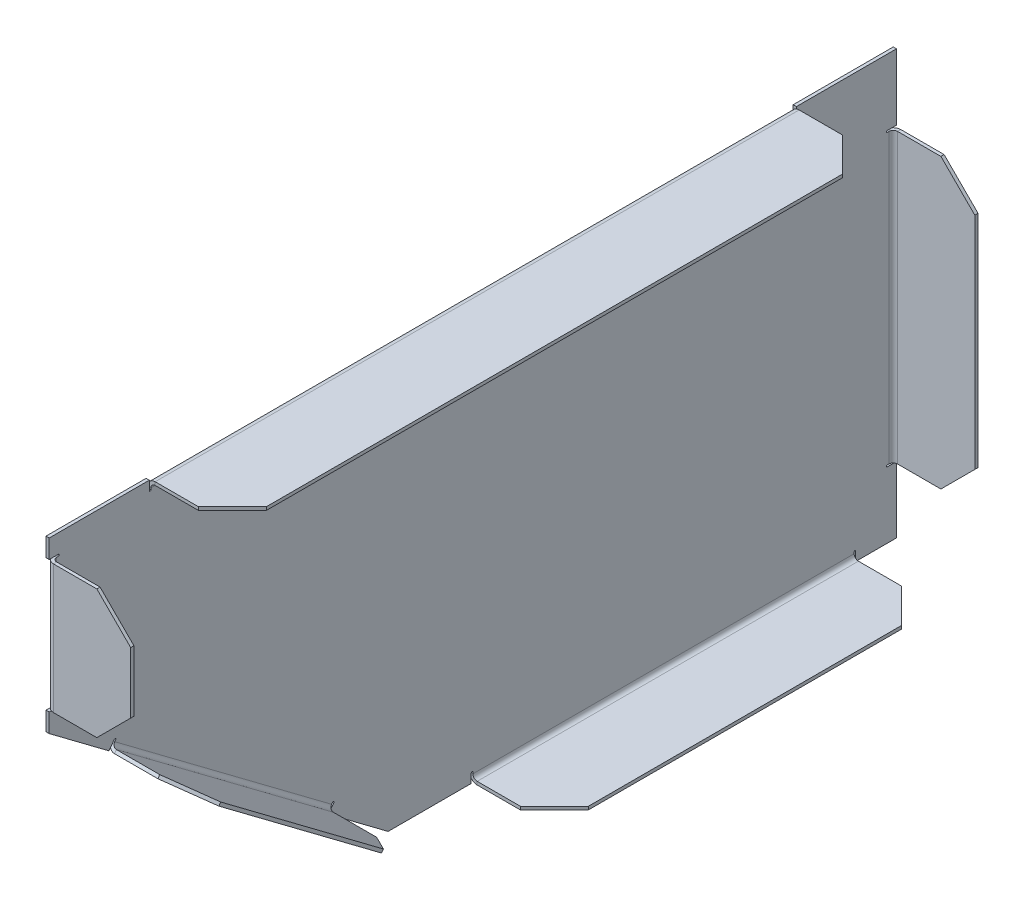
ISO-10303-21;
HEADER;
FILE_DESCRIPTION(('STEP AP214'),'2;1');
FILE_NAME('part.step','',(''),(''),'','','');
FILE_SCHEMA(('AUTOMOTIVE_DESIGN { 1 0 10303 214 1 1 1 1 }'));
ENDSEC;
DATA;
#1=APPLICATION_CONTEXT('core data for automotive mechanical design processes');
#2=APPLICATION_PROTOCOL_DEFINITION('international standard','automotive_design',2000,#1);
#3=PRODUCT_CONTEXT('',#1,'mechanical');
#4=PRODUCT('Part','Part','',(#3));
#5=PRODUCT_RELATED_PRODUCT_CATEGORY('part','',(#4));
#6=PRODUCT_DEFINITION_FORMATION('','',#4);
#7=PRODUCT_DEFINITION_CONTEXT('part definition',#1,'design');
#8=PRODUCT_DEFINITION('design','',#6,#7);
#9=PRODUCT_DEFINITION_SHAPE('','',#8);
#10=(LENGTH_UNIT() NAMED_UNIT(*) SI_UNIT(.MILLI.,.METRE.));
#11=(NAMED_UNIT(*) PLANE_ANGLE_UNIT() SI_UNIT($,.RADIAN.));
#12=(NAMED_UNIT(*) SI_UNIT($,.STERADIAN.) SOLID_ANGLE_UNIT());
#13=UNCERTAINTY_MEASURE_WITH_UNIT(LENGTH_MEASURE(1.E-05),#10,'distance_accuracy_value','');
#14=(GEOMETRIC_REPRESENTATION_CONTEXT(3) GLOBAL_UNCERTAINTY_ASSIGNED_CONTEXT((#13)) GLOBAL_UNIT_ASSIGNED_CONTEXT((#10,
#11,#12)) REPRESENTATION_CONTEXT('',''));
#15=CARTESIAN_POINT('',(0.,0.,0.));
#16=DIRECTION('',(0.,0.,1.));
#17=DIRECTION('',(1.,0.,0.));
#18=AXIS2_PLACEMENT_3D('',#15,#16,#17);
#19=CARTESIAN_POINT('',(-148.10262,0.,0.));
#20=DIRECTION('',(1.,0.,0.));
#21=DIRECTION('',(0.,0.,-1.));
#22=AXIS2_PLACEMENT_3D('',#19,#20,#21);
#23=PLANE('',#22);
#24=CARTESIAN_POINT('',(-148.10262,210.474345,-294.61393));
#25=DIRECTION('',(1.,0.,0.));
#26=DIRECTION('',(0.,0.,-1.));
#27=AXIS2_PLACEMENT_3D('',#24,#25,#26);
#28=CIRCLE('',#27,0.474345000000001);
#29=CARTESIAN_POINT('',(-148.10262,210.94869,-294.61393));
#30=VERTEX_POINT('',#29);
#31=CARTESIAN_POINT('',(-148.10262,210.,-294.61393));
#32=VERTEX_POINT('',#31);
#33=EDGE_CURVE('E870',#30,#32,#28,.T.);
#34=ORIENTED_EDGE('',*,*,#33,.F.);
#35=DIRECTION('',(0.,0.,1.));
#36=VECTOR('',#35,1.);
#37=CARTESIAN_POINT('',(-148.10262,210.94869,-300.));
#38=LINE('',#37,#36);
#39=CARTESIAN_POINT('',(-148.10262,210.94869,-300.));
#40=VERTEX_POINT('',#39);
#41=EDGE_CURVE('E865',#40,#30,#38,.T.);
#42=ORIENTED_EDGE('',*,*,#41,.F.);
#43=DIRECTION('',(0.,1.,0.));
#44=VECTOR('',#43,1.);
#45=CARTESIAN_POINT('',(-148.10262,0.,-300.));
#46=LINE('',#45,#44);
#47=CARTESIAN_POINT('',(-148.10262,250.,-300.));
#48=VERTEX_POINT('',#47);
#49=EDGE_CURVE('E1072',#40,#48,#46,.T.);
#50=ORIENTED_EDGE('',*,*,#49,.T.);
#51=DIRECTION('',(0.,0.,1.));
#52=VECTOR('',#51,1.);
#53=CARTESIAN_POINT('',(-148.10262,250.,-300.));
#54=LINE('',#53,#52);
#55=CARTESIAN_POINT('',(-148.10262,250.,-240.94869));
#56=VERTEX_POINT('',#55);
#57=EDGE_CURVE('E1077',#48,#56,#54,.T.);
#58=ORIENTED_EDGE('',*,*,#57,.T.);
#59=DIRECTION('',(0.,1.,0.));
#60=VECTOR('',#59,1.);
#61=CARTESIAN_POINT('',(-148.10262,244.61393,-240.94869));
#62=LINE('',#61,#60);
#63=CARTESIAN_POINT('',(-148.10262,244.61393,-240.94869));
#64=VERTEX_POINT('',#63);
#65=EDGE_CURVE('E1049',#64,#56,#62,.T.);
#66=ORIENTED_EDGE('',*,*,#65,.F.);
#67=CARTESIAN_POINT('',(-148.10262,244.61393,-240.474345));
#68=DIRECTION('',(1.,0.,0.));
#69=DIRECTION('',(0.,0.,-1.));
#70=AXIS2_PLACEMENT_3D('',#67,#68,#69);
#71=CIRCLE('',#70,0.474345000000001);
#72=CARTESIAN_POINT('',(-148.10262,244.61393,-240.));
#73=VERTEX_POINT('',#72);
#74=EDGE_CURVE('E1045',#73,#64,#71,.T.);
#75=ORIENTED_EDGE('',*,*,#74,.F.);
#76=DIRECTION('',(0.,-1.,0.));
#77=VECTOR('',#76,1.);
#78=CARTESIAN_POINT('',(-148.10262,245.56262,-240.));
#79=LINE('',#78,#77);
#80=CARTESIAN_POINT('',(-148.10262,245.56262,-240.));
#81=VERTEX_POINT('',#80);
#82=EDGE_CURVE('E1042',#81,#73,#79,.T.);
#83=ORIENTED_EDGE('',*,*,#82,.F.);
#84=DIRECTION('',(0.,0.,1.));
#85=VECTOR('',#84,1.);
#86=CARTESIAN_POINT('',(-148.10262,245.56262,140.));
#87=LINE('',#86,#85);
#88=CARTESIAN_POINT('',(-148.10262,245.56262,140.));
#89=VERTEX_POINT('',#88);
#90=EDGE_CURVE('E855',#89,#81,#87,.F.);
#91=ORIENTED_EDGE('',*,*,#90,.F.);
#92=DIRECTION('',(0.,1.,0.));
#93=VECTOR('',#92,1.);
#94=CARTESIAN_POINT('',(-148.10262,244.61393,140.));
#95=LINE('',#94,#93);
#96=CARTESIAN_POINT('',(-148.10262,244.61393,140.));
#97=VERTEX_POINT('',#96);
#98=EDGE_CURVE('E1038',#97,#89,#95,.T.);
#99=ORIENTED_EDGE('',*,*,#98,.F.);
#100=CARTESIAN_POINT('',(-148.10262,244.61393,140.474345));
#101=DIRECTION('',(1.,0.,0.));
#102=DIRECTION('',(0.,0.,-1.));
#103=AXIS2_PLACEMENT_3D('',#100,#101,#102);
#104=CIRCLE('',#103,0.474345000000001);
#105=CARTESIAN_POINT('',(-148.10262,244.61393,140.94869));
#106=VERTEX_POINT('',#105);
#107=EDGE_CURVE('E1034',#106,#97,#104,.T.);
#108=ORIENTED_EDGE('',*,*,#107,.F.);
#109=DIRECTION('',(0.,-1.,0.));
#110=VECTOR('',#109,1.);
#111=CARTESIAN_POINT('',(-148.10262,250.,140.94869));
#112=LINE('',#111,#110);
#113=CARTESIAN_POINT('',(-148.10262,250.,140.94869));
#114=VERTEX_POINT('',#113);
#115=EDGE_CURVE('E1029',#114,#106,#112,.T.);
#116=ORIENTED_EDGE('',*,*,#115,.F.);
#117=CARTESIAN_POINT('',(-148.10262,250.,200.));
#118=VERTEX_POINT('',#117);
#119=EDGE_CURVE('E1076',#114,#118,#54,.T.);
#120=ORIENTED_EDGE('',*,*,#119,.T.);
#121=DIRECTION('',(0.,-1.,0.));
#122=VECTOR('',#121,1.);
#123=CARTESIAN_POINT('',(-148.10262,250.,200.));
#124=LINE('',#123,#122);
#125=CARTESIAN_POINT('',(-148.10262,238.94869,200.));
#126=VERTEX_POINT('',#125);
#127=EDGE_CURVE('E1081',#118,#126,#124,.T.);
#128=ORIENTED_EDGE('',*,*,#127,.T.);
#129=DIRECTION('',(0.,0.,1.));
#130=VECTOR('',#129,1.);
#131=CARTESIAN_POINT('',(-148.10262,238.94869,194.61393));
#132=LINE('',#131,#130);
#133=CARTESIAN_POINT('',(-148.10262,238.94869,194.61393));
#134=VERTEX_POINT('',#133);
#135=EDGE_CURVE('E1008',#134,#126,#132,.T.);
#136=ORIENTED_EDGE('',*,*,#135,.F.);
#137=CARTESIAN_POINT('',(-148.10262,238.474345,194.61393));
#138=DIRECTION('',(1.,0.,0.));
#139=DIRECTION('',(0.,0.,-1.));
#140=AXIS2_PLACEMENT_3D('',#137,#138,#139);
#141=CIRCLE('',#140,0.474345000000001);
#142=CARTESIAN_POINT('',(-148.10262,238.,194.61393));
#143=VERTEX_POINT('',#142);
#144=EDGE_CURVE('E1004',#143,#134,#141,.T.);
#145=ORIENTED_EDGE('',*,*,#144,.F.);
#146=DIRECTION('',(0.,0.,-1.));
#147=VECTOR('',#146,1.);
#148=CARTESIAN_POINT('',(-148.10262,238.,195.56262));
#149=LINE('',#148,#147);
#150=CARTESIAN_POINT('',(-148.10262,238.,195.56262));
#151=VERTEX_POINT('',#150);
#152=EDGE_CURVE('E1001',#151,#143,#149,.T.);
#153=ORIENTED_EDGE('',*,*,#152,.F.);
#154=DIRECTION('',(0.,-1.,0.));
#155=VECTOR('',#154,1.);
#156=CARTESIAN_POINT('',(-148.10262,162.,195.56262));
#157=LINE('',#156,#155);
#158=CARTESIAN_POINT('',(-148.10262,162.,195.56262));
#159=VERTEX_POINT('',#158);
#160=EDGE_CURVE('E806',#159,#151,#157,.F.);
#161=ORIENTED_EDGE('',*,*,#160,.F.);
#162=DIRECTION('',(0.,0.,1.));
#163=VECTOR('',#162,1.);
#164=CARTESIAN_POINT('',(-148.10262,162.,194.61393));
#165=LINE('',#164,#163);
#166=CARTESIAN_POINT('',(-148.10262,162.,194.61393));
#167=VERTEX_POINT('',#166);
#168=EDGE_CURVE('E997',#167,#159,#165,.T.);
#169=ORIENTED_EDGE('',*,*,#168,.F.);
#170=CARTESIAN_POINT('',(-148.10262,161.525655,194.61393));
#171=DIRECTION('',(1.,0.,0.));
#172=DIRECTION('',(0.,0.,-1.));
#173=AXIS2_PLACEMENT_3D('',#170,#171,#172);
#174=CIRCLE('',#173,0.474345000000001);
#175=CARTESIAN_POINT('',(-148.10262,161.05131,194.61393));
#176=VERTEX_POINT('',#175);
#177=EDGE_CURVE('E993',#176,#167,#174,.T.);
#178=ORIENTED_EDGE('',*,*,#177,.F.);
#179=DIRECTION('',(0.,0.,-1.));
#180=VECTOR('',#179,1.);
#181=CARTESIAN_POINT('',(-148.10262,161.05131,200.));
#182=LINE('',#181,#180);
#183=CARTESIAN_POINT('',(-148.10262,161.05131,200.));
#184=VERTEX_POINT('',#183);
#185=EDGE_CURVE('E988',#184,#176,#182,.T.);
#186=ORIENTED_EDGE('',*,*,#185,.F.);
#187=CARTESIAN_POINT('',(-148.10262,150.,200.));
#188=VERTEX_POINT('',#187);
#189=EDGE_CURVE('E1080',#184,#188,#124,.T.);
#190=ORIENTED_EDGE('',*,*,#189,.T.);
#191=DIRECTION('',(0.,-0.6,-0.8));
#192=VECTOR('',#191,1.);
#193=CARTESIAN_POINT('',(-148.10262,150.,200.));
#194=LINE('',#193,#192);
#195=CARTESIAN_POINT('',(-148.10262,123.569214,164.758952));
#196=VERTEX_POINT('',#195);
#197=EDGE_CURVE('E1064',#188,#196,#194,.T.);
#198=ORIENTED_EDGE('',*,*,#197,.T.);
#199=DIRECTION('',(0.,-0.800000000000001,0.599999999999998));
#200=VECTOR('',#199,1.);
#201=CARTESIAN_POINT('',(-148.10262,127.87807,161.52731));
#202=LINE('',#201,#200);
#203=CARTESIAN_POINT('',(-148.10262,127.87807,161.52731));
#204=VERTEX_POINT('',#203);
#205=EDGE_CURVE('E967',#204,#196,#202,.T.);
#206=ORIENTED_EDGE('',*,*,#205,.F.);
#207=CARTESIAN_POINT('',(-148.10262,127.593463,161.147834));
#208=DIRECTION('',(1.,0.,0.));
#209=DIRECTION('',(0.,0.,-1.));
#210=AXIS2_PLACEMENT_3D('',#207,#208,#209);
#211=CIRCLE('',#210,0.474345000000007);
#212=CARTESIAN_POINT('',(-148.10262,127.308856,160.768358));
#213=VERTEX_POINT('',#212);
#214=EDGE_CURVE('E963',#213,#204,#211,.T.);
#215=ORIENTED_EDGE('',*,*,#214,.F.);
#216=DIRECTION('',(0.,0.799999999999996,-0.600000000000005));
#217=VECTOR('',#216,1.);
#218=CARTESIAN_POINT('',(-148.10262,126.549904,161.337572));
#219=LINE('',#218,#217);
#220=CARTESIAN_POINT('',(-148.10262,126.549904,161.337572));
#221=VERTEX_POINT('',#220);
#222=EDGE_CURVE('E960',#221,#213,#219,.T.);
#223=ORIENTED_EDGE('',*,*,#222,.F.);
#224=DIRECTION('',(0.,-0.6,-0.8));
#225=VECTOR('',#224,1.);
#226=CARTESIAN_POINT('',(-148.10262,30.549904,33.337572));
#227=LINE('',#226,#225);
#228=CARTESIAN_POINT('',(-148.10262,30.549904,33.337572));
#229=VERTEX_POINT('',#228);
#230=EDGE_CURVE('E757',#229,#221,#227,.F.);
#231=ORIENTED_EDGE('',*,*,#230,.F.);
#232=DIRECTION('',(0.,-0.800000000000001,0.599999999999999));
#233=VECTOR('',#232,1.);
#234=CARTESIAN_POINT('',(-148.10262,31.308856,32.768358));
#235=LINE('',#234,#233);
#236=CARTESIAN_POINT('',(-148.10262,31.308856,32.768358));
#237=VERTEX_POINT('',#236);
#238=EDGE_CURVE('E956',#237,#229,#235,.T.);
#239=ORIENTED_EDGE('',*,*,#238,.F.);
#240=CARTESIAN_POINT('',(-148.10262,31.024249,32.388882));
#241=DIRECTION('',(1.,0.,0.));
#242=DIRECTION('',(0.,0.,-1.));
#243=AXIS2_PLACEMENT_3D('',#240,#241,#242);
#244=CIRCLE('',#243,0.474345);
#245=CARTESIAN_POINT('',(-148.10262,30.739642,32.009406));
#246=VERTEX_POINT('',#245);
#247=EDGE_CURVE('E952',#246,#237,#244,.T.);
#248=ORIENTED_EDGE('',*,*,#247,.F.);
#249=DIRECTION('',(0.,0.800000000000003,-0.599999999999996));
#250=VECTOR('',#249,1.);
#251=CARTESIAN_POINT('',(-148.10262,26.430786,35.241048));
#252=LINE('',#251,#250);
#253=CARTESIAN_POINT('',(-148.10262,26.4307859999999,35.2410479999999));
#254=VERTEX_POINT('',#253);
#255=EDGE_CURVE('E947',#254,#246,#252,.T.);
#256=ORIENTED_EDGE('',*,*,#255,.F.);
#257=CARTESIAN_POINT('',(-148.10262,0.,0.));
#258=VERTEX_POINT('',#257);
#259=EDGE_CURVE('E1068',#254,#258,#194,.T.);
#260=ORIENTED_EDGE('',*,*,#259,.T.);
#261=DIRECTION('',(0.,0.,-1.));
#262=VECTOR('',#261,1.);
#263=CARTESIAN_POINT('',(-148.10262,0.,0.));
#264=LINE('',#263,#262);
#265=CARTESIAN_POINT('',(-148.10262,0.,-49.05131));
#266=VERTEX_POINT('',#265);
#267=EDGE_CURVE('E1069',#258,#266,#264,.T.);
#268=ORIENTED_EDGE('',*,*,#267,.T.);
#269=DIRECTION('',(0.,-1.,0.));
#270=VECTOR('',#269,1.);
#271=CARTESIAN_POINT('',(-148.10262,5.38606999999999,-49.05131));
#272=LINE('',#271,#270);
#273=CARTESIAN_POINT('',(-148.10262,5.38606999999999,-49.05131));
#274=VERTEX_POINT('',#273);
#275=EDGE_CURVE('E926',#274,#266,#272,.T.);
#276=ORIENTED_EDGE('',*,*,#275,.F.);
#277=CARTESIAN_POINT('',(-148.10262,5.38606999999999,-49.525655));
#278=DIRECTION('',(1.,0.,0.));
#279=DIRECTION('',(0.,0.,-1.));
#280=AXIS2_PLACEMENT_3D('',#277,#278,#279);
#281=CIRCLE('',#280,0.474345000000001);
#282=CARTESIAN_POINT('',(-148.10262,5.38606999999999,-50.));
#283=VERTEX_POINT('',#282);
#284=EDGE_CURVE('E922',#283,#274,#281,.T.);
#285=ORIENTED_EDGE('',*,*,#284,.F.);
#286=DIRECTION('',(0.,1.,0.));
#287=VECTOR('',#286,1.);
#288=CARTESIAN_POINT('',(-148.10262,4.43737999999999,-50.));
#289=LINE('',#288,#287);
#290=CARTESIAN_POINT('',(-148.10262,4.43737999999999,-50.));
#291=VERTEX_POINT('',#290);
#292=EDGE_CURVE('E919',#291,#283,#289,.T.);
#293=ORIENTED_EDGE('',*,*,#292,.F.);
#294=DIRECTION('',(0.,0.,-1.));
#295=VECTOR('',#294,1.);
#296=CARTESIAN_POINT('',(-148.10262,4.43737999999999,-275.));
#297=LINE('',#296,#295);
#298=CARTESIAN_POINT('',(-148.10262,4.43737999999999,-275.));
#299=VERTEX_POINT('',#298);
#300=EDGE_CURVE('E708',#299,#291,#297,.F.);
#301=ORIENTED_EDGE('',*,*,#300,.F.);
#302=DIRECTION('',(0.,-1.,0.));
#303=VECTOR('',#302,1.);
#304=CARTESIAN_POINT('',(-148.10262,5.38606999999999,-275.));
#305=LINE('',#304,#303);
#306=CARTESIAN_POINT('',(-148.10262,5.38606999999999,-275.));
#307=VERTEX_POINT('',#306);
#308=EDGE_CURVE('E915',#307,#299,#305,.T.);
#309=ORIENTED_EDGE('',*,*,#308,.F.);
#310=CARTESIAN_POINT('',(-148.10262,5.38606999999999,-275.474345));
#311=DIRECTION('',(1.,0.,0.));
#312=DIRECTION('',(0.,0.,-1.));
#313=AXIS2_PLACEMENT_3D('',#310,#311,#312);
#314=CIRCLE('',#313,0.474344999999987);
#315=CARTESIAN_POINT('',(-148.10262,5.38606999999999,-275.94869));
#316=VERTEX_POINT('',#315);
#317=EDGE_CURVE('E911',#316,#307,#314,.T.);
#318=ORIENTED_EDGE('',*,*,#317,.F.);
#319=DIRECTION('',(0.,1.,0.));
#320=VECTOR('',#319,1.);
#321=CARTESIAN_POINT('',(-148.10262,0.,-275.94869));
#322=LINE('',#321,#320);
#323=CARTESIAN_POINT('',(-148.10262,0.,-275.94869));
#324=VERTEX_POINT('',#323);
#325=EDGE_CURVE('E906',#324,#316,#322,.T.);
#326=ORIENTED_EDGE('',*,*,#325,.F.);
#327=CARTESIAN_POINT('',(-148.10262,0.,-300.));
#328=VERTEX_POINT('',#327);
#329=EDGE_CURVE('E1067',#324,#328,#264,.T.);
#330=ORIENTED_EDGE('',*,*,#329,.T.);
#331=CARTESIAN_POINT('',(-148.10262,39.05131,-300.));
#332=VERTEX_POINT('',#331);
#333=EDGE_CURVE('E1073',#328,#332,#46,.T.);
#334=ORIENTED_EDGE('',*,*,#333,.T.);
#335=DIRECTION('',(0.,0.,-1.));
#336=VECTOR('',#335,1.);
#337=CARTESIAN_POINT('',(-148.10262,39.05131,-294.61393));
#338=LINE('',#337,#336);
#339=CARTESIAN_POINT('',(-148.10262,39.05131,-294.61393));
#340=VERTEX_POINT('',#339);
#341=EDGE_CURVE('E885',#340,#332,#338,.T.);
#342=ORIENTED_EDGE('',*,*,#341,.F.);
#343=CARTESIAN_POINT('',(-148.10262,39.525655,-294.61393));
#344=DIRECTION('',(1.,0.,0.));
#345=DIRECTION('',(0.,0.,-1.));
#346=AXIS2_PLACEMENT_3D('',#343,#344,#345);
#347=CIRCLE('',#346,0.474345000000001);
#348=CARTESIAN_POINT('',(-148.10262,40.,-294.61393));
#349=VERTEX_POINT('',#348);
#350=EDGE_CURVE('E881',#349,#340,#347,.T.);
#351=ORIENTED_EDGE('',*,*,#350,.F.);
#352=DIRECTION('',(0.,0.,1.));
#353=VECTOR('',#352,1.);
#354=CARTESIAN_POINT('',(-148.10262,40.,-295.56262));
#355=LINE('',#354,#353);
#356=CARTESIAN_POINT('',(-148.10262,40.,-295.56262));
#357=VERTEX_POINT('',#356);
#358=EDGE_CURVE('E878',#357,#349,#355,.T.);
#359=ORIENTED_EDGE('',*,*,#358,.F.);
#360=DIRECTION('',(0.,1.,0.));
#361=VECTOR('',#360,1.);
#362=CARTESIAN_POINT('',(-148.10262,210.,-295.56262));
#363=LINE('',#362,#361);
#364=CARTESIAN_POINT('',(-148.10262,210.,-295.56262));
#365=VERTEX_POINT('',#364);
#366=EDGE_CURVE('E660',#365,#357,#363,.F.);
#367=ORIENTED_EDGE('',*,*,#366,.F.);
#368=DIRECTION('',(0.,0.,-1.));
#369=VECTOR('',#368,1.);
#370=CARTESIAN_POINT('',(-148.10262,210.,-294.61393));
#371=LINE('',#370,#369);
#372=EDGE_CURVE('E874',#32,#365,#371,.T.);
#373=ORIENTED_EDGE('',*,*,#372,.F.);
#374=EDGE_LOOP('',(#34,#42,#50,#58,#66,#75,#83,#91,#99,#108,#116,#120,#128,#136,#145,#153,#161,
#169,#178,#186,#190,#198,#206,#215,#223,#231,#239,#248,#256,#260,#268,#276,#285,#293,#301,#309,
#318,#326,#330,#334,#342,#351,#359,#367,#373));
#375=FACE_BOUND('',#374,.T.);
#376=ADVANCED_FACE('F136',(#375),#23,.T.);
#377=CARTESIAN_POINT('',(-150.,0.,0.));
#378=DIRECTION('',(1.,0.,0.));
#379=DIRECTION('',(0.,0.,-1.));
#380=AXIS2_PLACEMENT_3D('',#377,#378,#379);
#381=PLANE('',#380);
#382=DIRECTION('',(0.,0.,-1.));
#383=VECTOR('',#382,1.);
#384=CARTESIAN_POINT('',(-150.,210.94869,0.));
#385=LINE('',#384,#383);
#386=CARTESIAN_POINT('',(-150.,210.94869,-294.61393));
#387=VERTEX_POINT('',#386);
#388=CARTESIAN_POINT('',(-150.,210.94869,-300.));
#389=VERTEX_POINT('',#388);
#390=EDGE_CURVE('E902',#387,#389,#385,.T.);
#391=ORIENTED_EDGE('',*,*,#390,.F.);
#392=CARTESIAN_POINT('',(-150.,210.474345,-294.61393));
#393=DIRECTION('',(1.,0.,0.));
#394=DIRECTION('',(0.,0.,-1.));
#395=AXIS2_PLACEMENT_3D('',#392,#393,#394);
#396=CIRCLE('',#395,0.474345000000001);
#397=CARTESIAN_POINT('',(-150.,210.,-294.61393));
#398=VERTEX_POINT('',#397);
#399=EDGE_CURVE('E1177',#398,#387,#396,.F.);
#400=ORIENTED_EDGE('',*,*,#399,.F.);
#401=DIRECTION('',(0.,0.,1.));
#402=VECTOR('',#401,1.);
#403=CARTESIAN_POINT('',(-150.,210.,0.));
#404=LINE('',#403,#402);
#405=CARTESIAN_POINT('',(-150.,210.,-295.56262));
#406=VERTEX_POINT('',#405);
#407=EDGE_CURVE('E1174',#406,#398,#404,.T.);
#408=ORIENTED_EDGE('',*,*,#407,.F.);
#409=DIRECTION('',(0.,1.,0.));
#410=VECTOR('',#409,1.);
#411=CARTESIAN_POINT('',(-150.,210.,-295.56262));
#412=LINE('',#411,#410);
#413=CARTESIAN_POINT('',(-150.,40.,-295.56262));
#414=VERTEX_POINT('',#413);
#415=EDGE_CURVE('E611',#406,#414,#412,.F.);
#416=ORIENTED_EDGE('',*,*,#415,.T.);
#417=DIRECTION('',(0.,0.,-1.));
#418=VECTOR('',#417,1.);
#419=CARTESIAN_POINT('',(-150.,40.,0.));
#420=LINE('',#419,#418);
#421=CARTESIAN_POINT('',(-150.,40.,-294.61393));
#422=VERTEX_POINT('',#421);
#423=EDGE_CURVE('E1171',#422,#414,#420,.T.);
#424=ORIENTED_EDGE('',*,*,#423,.F.);
#425=CARTESIAN_POINT('',(-150.,39.525655,-294.61393));
#426=DIRECTION('',(1.,0.,0.));
#427=DIRECTION('',(0.,0.,-1.));
#428=AXIS2_PLACEMENT_3D('',#425,#426,#427);
#429=CIRCLE('',#428,0.474345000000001);
#430=CARTESIAN_POINT('',(-150.,39.05131,-294.61393));
#431=VERTEX_POINT('',#430);
#432=EDGE_CURVE('E1168',#431,#422,#429,.F.);
#433=ORIENTED_EDGE('',*,*,#432,.F.);
#434=DIRECTION('',(0.,0.,1.));
#435=VECTOR('',#434,1.);
#436=CARTESIAN_POINT('',(-150.,39.05131,0.));
#437=LINE('',#436,#435);
#438=CARTESIAN_POINT('',(-150.,39.05131,-300.));
#439=VERTEX_POINT('',#438);
#440=EDGE_CURVE('E868',#439,#431,#437,.T.);
#441=ORIENTED_EDGE('',*,*,#440,.F.);
#442=DIRECTION('',(0.,1.,0.));
#443=VECTOR('',#442,1.);
#444=CARTESIAN_POINT('',(-150.,0.,-300.));
#445=LINE('',#444,#443);
#446=CARTESIAN_POINT('',(-150.,0.,-300.));
#447=VERTEX_POINT('',#446);
#448=EDGE_CURVE('E1091',#447,#439,#445,.T.);
#449=ORIENTED_EDGE('',*,*,#448,.F.);
#450=DIRECTION('',(0.,0.,-1.));
#451=VECTOR('',#450,1.);
#452=CARTESIAN_POINT('',(-150.,0.,0.));
#453=LINE('',#452,#451);
#454=CARTESIAN_POINT('',(-150.,0.,-275.94869));
#455=VERTEX_POINT('',#454);
#456=EDGE_CURVE('E1087',#455,#447,#453,.T.);
#457=ORIENTED_EDGE('',*,*,#456,.F.);
#458=DIRECTION('',(0.,-1.,0.));
#459=VECTOR('',#458,1.);
#460=CARTESIAN_POINT('',(-150.,0.,-275.94869));
#461=LINE('',#460,#459);
#462=CARTESIAN_POINT('',(-150.,5.38606999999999,-275.94869));
#463=VERTEX_POINT('',#462);
#464=EDGE_CURVE('E943',#463,#455,#461,.T.);
#465=ORIENTED_EDGE('',*,*,#464,.F.);
#466=CARTESIAN_POINT('',(-150.,5.38606999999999,-275.474345));
#467=DIRECTION('',(1.,0.,0.));
#468=DIRECTION('',(0.,0.,-1.));
#469=AXIS2_PLACEMENT_3D('',#466,#467,#468);
#470=CIRCLE('',#469,0.474344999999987);
#471=CARTESIAN_POINT('',(-150.,5.38606999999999,-275.));
#472=VERTEX_POINT('',#471);
#473=EDGE_CURVE('E1165',#472,#463,#470,.F.);
#474=ORIENTED_EDGE('',*,*,#473,.F.);
#475=DIRECTION('',(0.,1.,0.));
#476=VECTOR('',#475,1.);
#477=CARTESIAN_POINT('',(-150.,0.,-275.));
#478=LINE('',#477,#476);
#479=CARTESIAN_POINT('',(-150.,4.43737999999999,-275.));
#480=VERTEX_POINT('',#479);
#481=EDGE_CURVE('E1162',#480,#472,#478,.T.);
#482=ORIENTED_EDGE('',*,*,#481,.F.);
#483=DIRECTION('',(0.,0.,-1.));
#484=VECTOR('',#483,1.);
#485=CARTESIAN_POINT('',(-150.,4.43737999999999,-275.));
#486=LINE('',#485,#484);
#487=CARTESIAN_POINT('',(-150.,4.43737999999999,-50.));
#488=VERTEX_POINT('',#487);
#489=EDGE_CURVE('E696',#480,#488,#486,.F.);
#490=ORIENTED_EDGE('',*,*,#489,.T.);
#491=DIRECTION('',(0.,-1.,0.));
#492=VECTOR('',#491,1.);
#493=CARTESIAN_POINT('',(-150.,0.,-50.));
#494=LINE('',#493,#492);
#495=CARTESIAN_POINT('',(-150.,5.38606999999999,-50.));
#496=VERTEX_POINT('',#495);
#497=EDGE_CURVE('E1159',#496,#488,#494,.T.);
#498=ORIENTED_EDGE('',*,*,#497,.F.);
#499=CARTESIAN_POINT('',(-150.,5.38606999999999,-49.525655));
#500=DIRECTION('',(1.,0.,0.));
#501=DIRECTION('',(0.,0.,-1.));
#502=AXIS2_PLACEMENT_3D('',#499,#500,#501);
#503=CIRCLE('',#502,0.474345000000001);
#504=CARTESIAN_POINT('',(-150.,5.38606999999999,-49.05131));
#505=VERTEX_POINT('',#504);
#506=EDGE_CURVE('E1156',#505,#496,#503,.F.);
#507=ORIENTED_EDGE('',*,*,#506,.F.);
#508=DIRECTION('',(0.,1.,0.));
#509=VECTOR('',#508,1.);
#510=CARTESIAN_POINT('',(-150.,0.,-49.05131));
#511=LINE('',#510,#509);
#512=CARTESIAN_POINT('',(-150.,0.,-49.05131));
#513=VERTEX_POINT('',#512);
#514=EDGE_CURVE('E909',#513,#505,#511,.T.);
#515=ORIENTED_EDGE('',*,*,#514,.F.);
#516=CARTESIAN_POINT('',(-150.,0.,0.));
#517=VERTEX_POINT('',#516);
#518=EDGE_CURVE('E1088',#517,#513,#453,.T.);
#519=ORIENTED_EDGE('',*,*,#518,.F.);
#520=DIRECTION('',(0.,-0.6,-0.8));
#521=VECTOR('',#520,1.);
#522=CARTESIAN_POINT('',(-150.,150.,200.));
#523=LINE('',#522,#521);
#524=CARTESIAN_POINT('',(-150.,26.4307859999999,35.2410479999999));
#525=VERTEX_POINT('',#524);
#526=EDGE_CURVE('E1032',#525,#517,#523,.T.);
#527=ORIENTED_EDGE('',*,*,#526,.F.);
#528=DIRECTION('',(0.,-0.800000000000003,0.599999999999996));
#529=VECTOR('',#528,1.);
#530=CARTESIAN_POINT('',(-150.,26.4307859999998,35.2410480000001));
#531=LINE('',#530,#529);
#532=CARTESIAN_POINT('',(-150.,30.739642,32.009406));
#533=VERTEX_POINT('',#532);
#534=EDGE_CURVE('E984',#533,#525,#531,.T.);
#535=ORIENTED_EDGE('',*,*,#534,.F.);
#536=CARTESIAN_POINT('',(-150.,31.024249,32.388882));
#537=DIRECTION('',(1.,0.,0.));
#538=DIRECTION('',(0.,0.,-1.));
#539=AXIS2_PLACEMENT_3D('',#536,#537,#538);
#540=CIRCLE('',#539,0.474345);
#541=CARTESIAN_POINT('',(-150.,31.308856,32.768358));
#542=VERTEX_POINT('',#541);
#543=EDGE_CURVE('E1153',#542,#533,#540,.F.);
#544=ORIENTED_EDGE('',*,*,#543,.F.);
#545=DIRECTION('',(0.,0.800000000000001,-0.599999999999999));
#546=VECTOR('',#545,1.);
#547=CARTESIAN_POINT('',(-150.,27.,36.));
#548=LINE('',#547,#546);
#549=CARTESIAN_POINT('',(-150.,30.549904,33.337572));
#550=VERTEX_POINT('',#549);
#551=EDGE_CURVE('E1150',#550,#542,#548,.T.);
#552=ORIENTED_EDGE('',*,*,#551,.F.);
#553=DIRECTION('',(0.,-0.6,-0.8));
#554=VECTOR('',#553,1.);
#555=CARTESIAN_POINT('',(-150.,30.549904,33.337572));
#556=LINE('',#555,#554);
#557=CARTESIAN_POINT('',(-150.,126.549904,161.337572));
#558=VERTEX_POINT('',#557);
#559=EDGE_CURVE('E745',#550,#558,#556,.F.);
#560=ORIENTED_EDGE('',*,*,#559,.T.);
#561=DIRECTION('',(0.,-0.799999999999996,0.600000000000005));
#562=VECTOR('',#561,1.);
#563=CARTESIAN_POINT('',(-150.,123.000000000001,163.999999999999));
#564=LINE('',#563,#562);
#565=CARTESIAN_POINT('',(-150.,127.308856,160.768358));
#566=VERTEX_POINT('',#565);
#567=EDGE_CURVE('E1147',#566,#558,#564,.T.);
#568=ORIENTED_EDGE('',*,*,#567,.F.);
#569=CARTESIAN_POINT('',(-150.,127.593463,161.147834));
#570=DIRECTION('',(1.,0.,0.));
#571=DIRECTION('',(0.,0.,-1.));
#572=AXIS2_PLACEMENT_3D('',#569,#570,#571);
#573=CIRCLE('',#572,0.474345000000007);
#574=CARTESIAN_POINT('',(-150.,127.87807,161.52731));
#575=VERTEX_POINT('',#574);
#576=EDGE_CURVE('E1144',#575,#566,#573,.F.);
#577=ORIENTED_EDGE('',*,*,#576,.F.);
#578=DIRECTION('',(0.,0.800000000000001,-0.599999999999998));
#579=VECTOR('',#578,1.);
#580=CARTESIAN_POINT('',(-150.,123.569214,164.758952));
#581=LINE('',#580,#579);
#582=CARTESIAN_POINT('',(-150.,123.569214,164.758952));
#583=VERTEX_POINT('',#582);
#584=EDGE_CURVE('E950',#583,#575,#581,.T.);
#585=ORIENTED_EDGE('',*,*,#584,.F.);
#586=CARTESIAN_POINT('',(-150.,150.,200.));
#587=VERTEX_POINT('',#586);
#588=EDGE_CURVE('E1085',#587,#583,#523,.T.);
#589=ORIENTED_EDGE('',*,*,#588,.F.);
#590=DIRECTION('',(0.,-1.,0.));
#591=VECTOR('',#590,1.);
#592=CARTESIAN_POINT('',(-150.,250.,200.));
#593=LINE('',#592,#591);
#594=CARTESIAN_POINT('',(-150.,161.05131,200.));
#595=VERTEX_POINT('',#594);
#596=EDGE_CURVE('E1097',#595,#587,#593,.T.);
#597=ORIENTED_EDGE('',*,*,#596,.F.);
#598=DIRECTION('',(0.,0.,1.));
#599=VECTOR('',#598,1.);
#600=CARTESIAN_POINT('',(-150.,161.05131,0.));
#601=LINE('',#600,#599);
#602=CARTESIAN_POINT('',(-150.,161.05131,194.61393));
#603=VERTEX_POINT('',#602);
#604=EDGE_CURVE('E1025',#603,#595,#601,.T.);
#605=ORIENTED_EDGE('',*,*,#604,.F.);
#606=CARTESIAN_POINT('',(-150.,161.525655,194.61393));
#607=DIRECTION('',(1.,0.,0.));
#608=DIRECTION('',(0.,0.,-1.));
#609=AXIS2_PLACEMENT_3D('',#606,#607,#608);
#610=CIRCLE('',#609,0.474345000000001);
#611=CARTESIAN_POINT('',(-150.,162.,194.61393));
#612=VERTEX_POINT('',#611);
#613=EDGE_CURVE('E1141',#612,#603,#610,.F.);
#614=ORIENTED_EDGE('',*,*,#613,.F.);
#615=DIRECTION('',(0.,0.,-1.));
#616=VECTOR('',#615,1.);
#617=CARTESIAN_POINT('',(-150.,162.,0.));
#618=LINE('',#617,#616);
#619=CARTESIAN_POINT('',(-150.,162.,195.56262));
#620=VERTEX_POINT('',#619);
#621=EDGE_CURVE('E1138',#620,#612,#618,.T.);
#622=ORIENTED_EDGE('',*,*,#621,.F.);
#623=DIRECTION('',(0.,-1.,0.));
#624=VECTOR('',#623,1.);
#625=CARTESIAN_POINT('',(-150.,162.,195.56262));
#626=LINE('',#625,#624);
#627=CARTESIAN_POINT('',(-150.,238.,195.56262));
#628=VERTEX_POINT('',#627);
#629=EDGE_CURVE('E794',#620,#628,#626,.F.);
#630=ORIENTED_EDGE('',*,*,#629,.T.);
#631=DIRECTION('',(0.,0.,1.));
#632=VECTOR('',#631,1.);
#633=CARTESIAN_POINT('',(-150.,238.,0.));
#634=LINE('',#633,#632);
#635=CARTESIAN_POINT('',(-150.,238.,194.61393));
#636=VERTEX_POINT('',#635);
#637=EDGE_CURVE('E1135',#636,#628,#634,.T.);
#638=ORIENTED_EDGE('',*,*,#637,.F.);
#639=CARTESIAN_POINT('',(-150.,238.474345,194.61393));
#640=DIRECTION('',(1.,0.,0.));
#641=DIRECTION('',(0.,0.,-1.));
#642=AXIS2_PLACEMENT_3D('',#639,#640,#641);
#643=CIRCLE('',#642,0.474345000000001);
#644=CARTESIAN_POINT('',(-150.,238.94869,194.61393));
#645=VERTEX_POINT('',#644);
#646=EDGE_CURVE('E1132',#645,#636,#643,.F.);
#647=ORIENTED_EDGE('',*,*,#646,.F.);
#648=DIRECTION('',(0.,0.,-1.));
#649=VECTOR('',#648,1.);
#650=CARTESIAN_POINT('',(-150.,238.94869,0.));
#651=LINE('',#650,#649);
#652=CARTESIAN_POINT('',(-150.,238.94869,200.));
#653=VERTEX_POINT('',#652);
#654=EDGE_CURVE('E991',#653,#645,#651,.T.);
#655=ORIENTED_EDGE('',*,*,#654,.F.);
#656=CARTESIAN_POINT('',(-150.,250.,200.));
#657=VERTEX_POINT('',#656);
#658=EDGE_CURVE('E1098',#657,#653,#593,.T.);
#659=ORIENTED_EDGE('',*,*,#658,.F.);
#660=DIRECTION('',(0.,0.,1.));
#661=VECTOR('',#660,1.);
#662=CARTESIAN_POINT('',(-150.,250.,-300.));
#663=LINE('',#662,#661);
#664=CARTESIAN_POINT('',(-150.,250.,140.94869));
#665=VERTEX_POINT('',#664);
#666=EDGE_CURVE('E1093',#665,#657,#663,.T.);
#667=ORIENTED_EDGE('',*,*,#666,.F.);
#668=DIRECTION('',(0.,1.,0.));
#669=VECTOR('',#668,1.);
#670=CARTESIAN_POINT('',(-150.,-7.26338874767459E-13,140.948689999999));
#671=LINE('',#670,#669);
#672=CARTESIAN_POINT('',(-150.,244.61393,140.94869));
#673=VERTEX_POINT('',#672);
#674=EDGE_CURVE('E1129',#673,#665,#671,.T.);
#675=ORIENTED_EDGE('',*,*,#674,.F.);
#676=CARTESIAN_POINT('',(-150.,244.61393,140.474345));
#677=DIRECTION('',(1.,0.,0.));
#678=DIRECTION('',(0.,0.,-1.));
#679=AXIS2_PLACEMENT_3D('',#676,#677,#678);
#680=CIRCLE('',#679,0.474345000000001);
#681=CARTESIAN_POINT('',(-150.,244.61393,140.));
#682=VERTEX_POINT('',#681);
#683=EDGE_CURVE('E1126',#682,#673,#680,.F.);
#684=ORIENTED_EDGE('',*,*,#683,.F.);
#685=DIRECTION('',(0.,-1.,0.));
#686=VECTOR('',#685,1.);
#687=CARTESIAN_POINT('',(-150.,0.,140.));
#688=LINE('',#687,#686);
#689=CARTESIAN_POINT('',(-150.,245.56262,140.));
#690=VERTEX_POINT('',#689);
#691=EDGE_CURVE('E1123',#690,#682,#688,.T.);
#692=ORIENTED_EDGE('',*,*,#691,.F.);
#693=DIRECTION('',(0.,0.,1.));
#694=VECTOR('',#693,1.);
#695=CARTESIAN_POINT('',(-150.,245.56262,140.));
#696=LINE('',#695,#694);
#697=CARTESIAN_POINT('',(-150.,245.56262,-240.));
#698=VERTEX_POINT('',#697);
#699=EDGE_CURVE('E843',#690,#698,#696,.F.);
#700=ORIENTED_EDGE('',*,*,#699,.T.);
#701=DIRECTION('',(0.,1.,0.));
#702=VECTOR('',#701,1.);
#703=CARTESIAN_POINT('',(-150.,0.,-240.));
#704=LINE('',#703,#702);
#705=CARTESIAN_POINT('',(-150.,244.61393,-240.));
#706=VERTEX_POINT('',#705);
#707=EDGE_CURVE('E1120',#706,#698,#704,.T.);
#708=ORIENTED_EDGE('',*,*,#707,.F.);
#709=CARTESIAN_POINT('',(-150.,244.61393,-240.474345));
#710=DIRECTION('',(1.,0.,0.));
#711=DIRECTION('',(0.,0.,-1.));
#712=AXIS2_PLACEMENT_3D('',#709,#710,#711);
#713=CIRCLE('',#712,0.474345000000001);
#714=CARTESIAN_POINT('',(-150.,244.61393,-240.94869));
#715=VERTEX_POINT('',#714);
#716=EDGE_CURVE('E1117',#715,#706,#713,.F.);
#717=ORIENTED_EDGE('',*,*,#716,.F.);
#718=DIRECTION('',(0.,-1.,0.));
#719=VECTOR('',#718,1.);
#720=CARTESIAN_POINT('',(-150.,0.,-240.94869));
#721=LINE('',#720,#719);
#722=CARTESIAN_POINT('',(-150.,250.,-240.94869));
#723=VERTEX_POINT('',#722);
#724=EDGE_CURVE('E1114',#723,#715,#721,.T.);
#725=ORIENTED_EDGE('',*,*,#724,.F.);
#726=CARTESIAN_POINT('',(-150.,250.,-300.));
#727=VERTEX_POINT('',#726);
#728=EDGE_CURVE('E1094',#727,#723,#663,.T.);
#729=ORIENTED_EDGE('',*,*,#728,.F.);
#730=EDGE_CURVE('E1090',#389,#727,#445,.T.);
#731=ORIENTED_EDGE('',*,*,#730,.F.);
#732=EDGE_LOOP('',(#391,#400,#408,#416,#424,#433,#441,#449,#457,#465,#474,#482,#490,#498,#507,
#515,#519,#527,#535,#544,#552,#560,#568,#577,#585,#589,#597,#605,#614,#622,#630,#638,#647,#655,
#659,#667,#675,#684,#692,#700,#708,#717,#725,#729,#731));
#733=FACE_BOUND('',#732,.T.);
#734=ADVANCED_FACE('F1281',(#733),#381,.F.);
#735=CARTESIAN_POINT('',(-148.10262,0.,-300.));
#736=DIRECTION('',(0.,0.,1.));
#737=DIRECTION('',(1.,0.,0.));
#738=AXIS2_PLACEMENT_3D('',#735,#736,#737);
#739=PLANE('',#738);
#740=DIRECTION('',(-1.,0.,0.));
#741=VECTOR('',#740,1.);
#742=CARTESIAN_POINT('',(-148.10262,210.94869,-300.));
#743=LINE('',#742,#741);
#744=EDGE_CURVE('E869',#40,#389,#743,.T.);
#745=ORIENTED_EDGE('',*,*,#744,.T.);
#746=ORIENTED_EDGE('',*,*,#730,.T.);
#747=DIRECTION('',(-1.,0.,0.));
#748=VECTOR('',#747,1.);
#749=CARTESIAN_POINT('',(-148.10262,250.,-300.));
#750=LINE('',#749,#748);
#751=EDGE_CURVE('E1105',#48,#727,#750,.T.);
#752=ORIENTED_EDGE('',*,*,#751,.F.);
#753=ORIENTED_EDGE('',*,*,#49,.F.);
#754=EDGE_LOOP('',(#745,#746,#752,#753));
#755=FACE_BOUND('',#754,.T.);
#756=ADVANCED_FACE('F1365',(#755),#739,.F.);
#757=DIRECTION('',(-1.,0.,0.));
#758=VECTOR('',#757,1.);
#759=CARTESIAN_POINT('',(-148.10262,39.05131,-300.));
#760=LINE('',#759,#758);
#761=EDGE_CURVE('E888',#332,#439,#760,.T.);
#762=ORIENTED_EDGE('',*,*,#761,.F.);
#763=ORIENTED_EDGE('',*,*,#333,.F.);
#764=DIRECTION('',(-1.,0.,0.));
#765=VECTOR('',#764,1.);
#766=CARTESIAN_POINT('',(-148.10262,0.,-300.));
#767=LINE('',#766,#765);
#768=EDGE_CURVE('E1108',#328,#447,#767,.T.);
#769=ORIENTED_EDGE('',*,*,#768,.T.);
#770=ORIENTED_EDGE('',*,*,#448,.T.);
#771=EDGE_LOOP('',(#762,#763,#769,#770));
#772=FACE_BOUND('',#771,.T.);
#773=ADVANCED_FACE('F1292',(#772),#739,.F.);
#774=CARTESIAN_POINT('',(-148.10262,0.,0.));
#775=DIRECTION('',(0.,1.,0.));
#776=DIRECTION('',(0.,0.,1.));
#777=AXIS2_PLACEMENT_3D('',#774,#775,#776);
#778=PLANE('',#777);
#779=DIRECTION('',(-1.,0.,0.));
#780=VECTOR('',#779,1.);
#781=CARTESIAN_POINT('',(-148.10262,0.,-275.94869));
#782=LINE('',#781,#780);
#783=EDGE_CURVE('E910',#324,#455,#782,.T.);
#784=ORIENTED_EDGE('',*,*,#783,.T.);
#785=ORIENTED_EDGE('',*,*,#456,.T.);
#786=ORIENTED_EDGE('',*,*,#768,.F.);
#787=ORIENTED_EDGE('',*,*,#329,.F.);
#788=EDGE_LOOP('',(#784,#785,#786,#787));
#789=FACE_BOUND('',#788,.T.);
#790=ADVANCED_FACE('F1297',(#789),#778,.F.);
#791=DIRECTION('',(-1.,0.,0.));
#792=VECTOR('',#791,1.);
#793=CARTESIAN_POINT('',(-148.10262,0.,-49.05131));
#794=LINE('',#793,#792);
#795=EDGE_CURVE('E929',#266,#513,#794,.T.);
#796=ORIENTED_EDGE('',*,*,#795,.F.);
#797=ORIENTED_EDGE('',*,*,#267,.F.);
#798=DIRECTION('',(-1.,0.,0.));
#799=VECTOR('',#798,1.);
#800=CARTESIAN_POINT('',(-148.10262,0.,0.));
#801=LINE('',#800,#799);
#802=EDGE_CURVE('E1111',#258,#517,#801,.T.);
#803=ORIENTED_EDGE('',*,*,#802,.T.);
#804=ORIENTED_EDGE('',*,*,#518,.T.);
#805=EDGE_LOOP('',(#796,#797,#803,#804));
#806=FACE_BOUND('',#805,.T.);
#807=ADVANCED_FACE('F1387',(#806),#778,.F.);
#808=CARTESIAN_POINT('',(-148.10262,150.,200.));
#809=DIRECTION('',(0.,0.8,-0.6));
#810=DIRECTION('',(0.,0.6,0.8));
#811=AXIS2_PLACEMENT_3D('',#808,#809,#810);
#812=PLANE('',#811);
#813=DIRECTION('',(-1.,0.,0.));
#814=VECTOR('',#813,1.);
#815=CARTESIAN_POINT('',(-148.10262,26.430786,35.241048));
#816=LINE('',#815,#814);
#817=EDGE_CURVE('E951',#254,#525,#816,.T.);
#818=ORIENTED_EDGE('',*,*,#817,.T.);
#819=ORIENTED_EDGE('',*,*,#526,.T.);
#820=ORIENTED_EDGE('',*,*,#802,.F.);
#821=ORIENTED_EDGE('',*,*,#259,.F.);
#822=EDGE_LOOP('',(#818,#819,#820,#821));
#823=FACE_BOUND('',#822,.T.);
#824=ADVANCED_FACE('F1388',(#823),#812,.F.);
#825=DIRECTION('',(-1.,0.,0.));
#826=VECTOR('',#825,1.);
#827=CARTESIAN_POINT('',(-148.10262,123.569214,164.758952));
#828=LINE('',#827,#826);
#829=EDGE_CURVE('E970',#196,#583,#828,.T.);
#830=ORIENTED_EDGE('',*,*,#829,.F.);
#831=ORIENTED_EDGE('',*,*,#197,.F.);
#832=DIRECTION('',(-1.,0.,0.));
#833=VECTOR('',#832,1.);
#834=CARTESIAN_POINT('',(-148.10262,150.,200.));
#835=LINE('',#834,#833);
#836=EDGE_CURVE('E1084',#188,#587,#835,.T.);
#837=ORIENTED_EDGE('',*,*,#836,.T.);
#838=ORIENTED_EDGE('',*,*,#588,.T.);
#839=EDGE_LOOP('',(#830,#831,#837,#838));
#840=FACE_BOUND('',#839,.T.);
#841=ADVANCED_FACE('F1375',(#840),#812,.F.);
#842=CARTESIAN_POINT('',(-148.10262,250.,200.));
#843=DIRECTION('',(0.,0.,-1.));
#844=DIRECTION('',(-1.,0.,0.));
#845=AXIS2_PLACEMENT_3D('',#842,#843,#844);
#846=PLANE('',#845);
#847=DIRECTION('',(-1.,0.,0.));
#848=VECTOR('',#847,1.);
#849=CARTESIAN_POINT('',(-148.10262,161.05131,200.));
#850=LINE('',#849,#848);
#851=EDGE_CURVE('E992',#184,#595,#850,.T.);
#852=ORIENTED_EDGE('',*,*,#851,.T.);
#853=ORIENTED_EDGE('',*,*,#596,.T.);
#854=ORIENTED_EDGE('',*,*,#836,.F.);
#855=ORIENTED_EDGE('',*,*,#189,.F.);
#856=EDGE_LOOP('',(#852,#853,#854,#855));
#857=FACE_BOUND('',#856,.T.);
#858=ADVANCED_FACE('F1371',(#857),#846,.F.);
#859=DIRECTION('',(-1.,0.,0.));
#860=VECTOR('',#859,1.);
#861=CARTESIAN_POINT('',(-148.10262,238.94869,200.));
#862=LINE('',#861,#860);
#863=EDGE_CURVE('E1011',#126,#653,#862,.T.);
#864=ORIENTED_EDGE('',*,*,#863,.F.);
#865=ORIENTED_EDGE('',*,*,#127,.F.);
#866=DIRECTION('',(-1.,0.,0.));
#867=VECTOR('',#866,1.);
#868=CARTESIAN_POINT('',(-148.10262,250.,200.));
#869=LINE('',#868,#867);
#870=EDGE_CURVE('E1102',#118,#657,#869,.T.);
#871=ORIENTED_EDGE('',*,*,#870,.T.);
#872=ORIENTED_EDGE('',*,*,#658,.T.);
#873=EDGE_LOOP('',(#864,#865,#871,#872));
#874=FACE_BOUND('',#873,.T.);
#875=ADVANCED_FACE('F1374',(#874),#846,.F.);
#876=CARTESIAN_POINT('',(-148.10262,250.,-300.));
#877=DIRECTION('',(0.,-1.,0.));
#878=DIRECTION('',(0.,0.,-1.));
#879=AXIS2_PLACEMENT_3D('',#876,#877,#878);
#880=PLANE('',#879);
#881=DIRECTION('',(-1.,0.,0.));
#882=VECTOR('',#881,1.);
#883=CARTESIAN_POINT('',(-148.10262,250.,140.94869));
#884=LINE('',#883,#882);
#885=EDGE_CURVE('E1033',#114,#665,#884,.T.);
#886=ORIENTED_EDGE('',*,*,#885,.T.);
#887=ORIENTED_EDGE('',*,*,#666,.T.);
#888=ORIENTED_EDGE('',*,*,#870,.F.);
#889=ORIENTED_EDGE('',*,*,#119,.F.);
#890=EDGE_LOOP('',(#886,#887,#888,#889));
#891=FACE_BOUND('',#890,.T.);
#892=ADVANCED_FACE('F1377',(#891),#880,.F.);
#893=DIRECTION('',(-1.,0.,0.));
#894=VECTOR('',#893,1.);
#895=CARTESIAN_POINT('',(-148.10262,250.,-240.94869));
#896=LINE('',#895,#894);
#897=EDGE_CURVE('E1052',#56,#723,#896,.T.);
#898=ORIENTED_EDGE('',*,*,#897,.F.);
#899=ORIENTED_EDGE('',*,*,#57,.F.);
#900=ORIENTED_EDGE('',*,*,#751,.T.);
#901=ORIENTED_EDGE('',*,*,#728,.T.);
#902=EDGE_LOOP('',(#898,#899,#900,#901));
#903=FACE_BOUND('',#902,.T.);
#904=ADVANCED_FACE('F1380',(#903),#880,.F.);
#905=CARTESIAN_POINT('',(-148.10262,250.,140.94869));
#906=DIRECTION('',(0.,0.,-1.));
#907=DIRECTION('',(0.,1.,0.));
#908=AXIS2_PLACEMENT_3D('',#905,#906,#907);
#909=PLANE('',#908);
#910=DIRECTION('',(-1.,0.,0.));
#911=VECTOR('',#910,1.);
#912=CARTESIAN_POINT('',(-148.10262,244.61393,140.94869));
#913=LINE('',#912,#911);
#914=EDGE_CURVE('E1037',#106,#673,#913,.T.);
#915=ORIENTED_EDGE('',*,*,#914,.T.);
#916=ORIENTED_EDGE('',*,*,#674,.T.);
#917=ORIENTED_EDGE('',*,*,#885,.F.);
#918=ORIENTED_EDGE('',*,*,#115,.T.);
#919=EDGE_LOOP('',(#915,#916,#917,#918));
#920=FACE_BOUND('',#919,.T.);
#921=ADVANCED_FACE('F1368',(#920),#909,.T.);
#922=CARTESIAN_POINT('',(-148.10262,244.61393,140.474345));
#923=DIRECTION('',(-1.,0.,0.));
#924=DIRECTION('',(0.,0.,1.));
#925=AXIS2_PLACEMENT_3D('',#922,#923,#924);
#926=CYLINDRICAL_SURFACE('',#925,0.474345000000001);
#927=DIRECTION('',(-1.,0.,0.));
#928=VECTOR('',#927,1.);
#929=CARTESIAN_POINT('',(-148.10262,244.61393,140.));
#930=LINE('',#929,#928);
#931=EDGE_CURVE('E1041',#97,#682,#930,.T.);
#932=ORIENTED_EDGE('',*,*,#931,.T.);
#933=ORIENTED_EDGE('',*,*,#683,.T.);
#934=ORIENTED_EDGE('',*,*,#914,.F.);
#935=ORIENTED_EDGE('',*,*,#107,.T.);
#936=EDGE_LOOP('',(#932,#933,#934,#935));
#937=FACE_BOUND('',#936,.T.);
#938=ADVANCED_FACE('F2242',(#937),#926,.F.);
#939=CARTESIAN_POINT('',(-148.10262,244.61393,140.));
#940=DIRECTION('',(0.,0.,1.));
#941=DIRECTION('',(1.,0.,0.));
#942=AXIS2_PLACEMENT_3D('',#939,#940,#941);
#943=PLANE('',#942);
#944=DIRECTION('',(-1.,0.,0.));
#945=VECTOR('',#944,1.);
#946=CARTESIAN_POINT('',(-148.10262,245.56262,140.));
#947=LINE('',#946,#945);
#948=EDGE_CURVE('E849',#89,#690,#947,.T.);
#949=ORIENTED_EDGE('',*,*,#948,.T.);
#950=ORIENTED_EDGE('',*,*,#691,.T.);
#951=ORIENTED_EDGE('',*,*,#931,.F.);
#952=ORIENTED_EDGE('',*,*,#98,.T.);
#953=EDGE_LOOP('',(#949,#950,#951,#952));
#954=FACE_BOUND('',#953,.T.);
#955=ADVANCED_FACE('F2251',(#954),#943,.T.);
#956=CARTESIAN_POINT('',(-148.10262,245.56262,-240.));
#957=DIRECTION('',(0.,0.,-1.));
#958=DIRECTION('',(-1.,0.,0.));
#959=AXIS2_PLACEMENT_3D('',#956,#957,#958);
#960=PLANE('',#959);
#961=DIRECTION('',(-1.,0.,0.));
#962=VECTOR('',#961,1.);
#963=CARTESIAN_POINT('',(-148.10262,244.61393,-240.));
#964=LINE('',#963,#962);
#965=EDGE_CURVE('E1048',#73,#706,#964,.T.);
#966=ORIENTED_EDGE('',*,*,#965,.T.);
#967=ORIENTED_EDGE('',*,*,#707,.T.);
#968=DIRECTION('',(-1.,0.,0.));
#969=VECTOR('',#968,1.);
#970=CARTESIAN_POINT('',(-148.10262,245.56262,-240.));
#971=LINE('',#970,#969);
#972=EDGE_CURVE('E860',#81,#698,#971,.T.);
#973=ORIENTED_EDGE('',*,*,#972,.F.);
#974=ORIENTED_EDGE('',*,*,#82,.T.);
#975=EDGE_LOOP('',(#966,#967,#973,#974));
#976=FACE_BOUND('',#975,.T.);
#977=ADVANCED_FACE('F2260',(#976),#960,.T.);
#978=CARTESIAN_POINT('',(-148.10262,244.61393,-240.474345));
#979=DIRECTION('',(-1.,0.,0.));
#980=DIRECTION('',(0.,0.,1.));
#981=AXIS2_PLACEMENT_3D('',#978,#979,#980);
#982=CYLINDRICAL_SURFACE('',#981,0.474345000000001);
#983=DIRECTION('',(-1.,0.,0.));
#984=VECTOR('',#983,1.);
#985=CARTESIAN_POINT('',(-148.10262,244.61393,-240.94869));
#986=LINE('',#985,#984);
#987=EDGE_CURVE('E1028',#64,#715,#986,.T.);
#988=ORIENTED_EDGE('',*,*,#987,.T.);
#989=ORIENTED_EDGE('',*,*,#716,.T.);
#990=ORIENTED_EDGE('',*,*,#965,.F.);
#991=ORIENTED_EDGE('',*,*,#74,.T.);
#992=EDGE_LOOP('',(#988,#989,#990,#991));
#993=FACE_BOUND('',#992,.T.);
#994=ADVANCED_FACE('F2270',(#993),#982,.F.);
#995=CARTESIAN_POINT('',(-148.10262,244.61393,-240.94869));
#996=DIRECTION('',(0.,0.,1.));
#997=DIRECTION('',(1.,0.,0.));
#998=AXIS2_PLACEMENT_3D('',#995,#996,#997);
#999=PLANE('',#998);
#1000=ORIENTED_EDGE('',*,*,#897,.T.);
#1001=ORIENTED_EDGE('',*,*,#724,.T.);
#1002=ORIENTED_EDGE('',*,*,#987,.F.);
#1003=ORIENTED_EDGE('',*,*,#65,.T.);
#1004=EDGE_LOOP('',(#1000,#1001,#1002,#1003));
#1005=FACE_BOUND('',#1004,.T.);
#1006=ADVANCED_FACE('F2169',(#1005),#999,.T.);
#1007=CARTESIAN_POINT('',(-148.10262,161.525655,194.61393));
#1008=DIRECTION('',(-1.,0.,0.));
#1009=DIRECTION('',(0.,0.,1.));
#1010=AXIS2_PLACEMENT_3D('',#1007,#1008,#1009);
#1011=CYLINDRICAL_SURFACE('',#1010,0.474345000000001);
#1012=DIRECTION('',(-1.,0.,0.));
#1013=VECTOR('',#1012,1.);
#1014=CARTESIAN_POINT('',(-148.10262,162.,194.61393));
#1015=LINE('',#1014,#1013);
#1016=EDGE_CURVE('E1000',#167,#612,#1015,.T.);
#1017=ORIENTED_EDGE('',*,*,#1016,.T.);
#1018=ORIENTED_EDGE('',*,*,#613,.T.);
#1019=DIRECTION('',(-1.,0.,0.));
#1020=VECTOR('',#1019,1.);
#1021=CARTESIAN_POINT('',(-148.10262,161.05131,194.61393));
#1022=LINE('',#1021,#1020);
#1023=EDGE_CURVE('E996',#176,#603,#1022,.T.);
#1024=ORIENTED_EDGE('',*,*,#1023,.F.);
#1025=ORIENTED_EDGE('',*,*,#177,.T.);
#1026=EDGE_LOOP('',(#1017,#1018,#1024,#1025));
#1027=FACE_BOUND('',#1026,.T.);
#1028=ADVANCED_FACE('F2163',(#1027),#1011,.F.);
#1029=CARTESIAN_POINT('',(-148.10262,162.,194.61393));
#1030=DIRECTION('',(0.,-1.,0.));
#1031=DIRECTION('',(0.,0.,-1.));
#1032=AXIS2_PLACEMENT_3D('',#1029,#1030,#1031);
#1033=PLANE('',#1032);
#1034=DIRECTION('',(-1.,0.,0.));
#1035=VECTOR('',#1034,1.);
#1036=CARTESIAN_POINT('',(-148.10262,162.,195.56262));
#1037=LINE('',#1036,#1035);
#1038=EDGE_CURVE('E800',#159,#620,#1037,.T.);
#1039=ORIENTED_EDGE('',*,*,#1038,.T.);
#1040=ORIENTED_EDGE('',*,*,#621,.T.);
#1041=ORIENTED_EDGE('',*,*,#1016,.F.);
#1042=ORIENTED_EDGE('',*,*,#168,.T.);
#1043=EDGE_LOOP('',(#1039,#1040,#1041,#1042));
#1044=FACE_BOUND('',#1043,.T.);
#1045=ADVANCED_FACE('F2168',(#1044),#1033,.T.);
#1046=CARTESIAN_POINT('',(-148.10262,238.,195.56262));
#1047=DIRECTION('',(0.,1.,0.));
#1048=DIRECTION('',(0.,0.,1.));
#1049=AXIS2_PLACEMENT_3D('',#1046,#1047,#1048);
#1050=PLANE('',#1049);
#1051=DIRECTION('',(-1.,0.,0.));
#1052=VECTOR('',#1051,1.);
#1053=CARTESIAN_POINT('',(-148.10262,238.,194.61393));
#1054=LINE('',#1053,#1052);
#1055=EDGE_CURVE('E1007',#143,#636,#1054,.T.);
#1056=ORIENTED_EDGE('',*,*,#1055,.T.);
#1057=ORIENTED_EDGE('',*,*,#637,.T.);
#1058=DIRECTION('',(-1.,0.,0.));
#1059=VECTOR('',#1058,1.);
#1060=CARTESIAN_POINT('',(-148.10262,238.,195.56262));
#1061=LINE('',#1060,#1059);
#1062=EDGE_CURVE('E811',#151,#628,#1061,.T.);
#1063=ORIENTED_EDGE('',*,*,#1062,.F.);
#1064=ORIENTED_EDGE('',*,*,#152,.T.);
#1065=EDGE_LOOP('',(#1056,#1057,#1063,#1064));
#1066=FACE_BOUND('',#1065,.T.);
#1067=ADVANCED_FACE('F2180',(#1066),#1050,.T.);
#1068=CARTESIAN_POINT('',(-148.10262,238.474345,194.61393));
#1069=DIRECTION('',(-1.,0.,0.));
#1070=DIRECTION('',(0.,0.,1.));
#1071=AXIS2_PLACEMENT_3D('',#1068,#1069,#1070);
#1072=CYLINDRICAL_SURFACE('',#1071,0.474345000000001);
#1073=DIRECTION('',(-1.,0.,0.));
#1074=VECTOR('',#1073,1.);
#1075=CARTESIAN_POINT('',(-148.10262,238.94869,194.61393));
#1076=LINE('',#1075,#1074);
#1077=EDGE_CURVE('E987',#134,#645,#1076,.T.);
#1078=ORIENTED_EDGE('',*,*,#1077,.T.);
#1079=ORIENTED_EDGE('',*,*,#646,.T.);
#1080=ORIENTED_EDGE('',*,*,#1055,.F.);
#1081=ORIENTED_EDGE('',*,*,#144,.T.);
#1082=EDGE_LOOP('',(#1078,#1079,#1080,#1081));
#1083=FACE_BOUND('',#1082,.T.);
#1084=ADVANCED_FACE('F2190',(#1083),#1072,.F.);
#1085=CARTESIAN_POINT('',(-148.10262,161.05131,200.));
#1086=DIRECTION('',(0.,1.,0.));
#1087=DIRECTION('',(0.,0.,1.));
#1088=AXIS2_PLACEMENT_3D('',#1085,#1086,#1087);
#1089=PLANE('',#1088);
#1090=ORIENTED_EDGE('',*,*,#1023,.T.);
#1091=ORIENTED_EDGE('',*,*,#604,.T.);
#1092=ORIENTED_EDGE('',*,*,#851,.F.);
#1093=ORIENTED_EDGE('',*,*,#185,.T.);
#1094=EDGE_LOOP('',(#1090,#1091,#1092,#1093));
#1095=FACE_BOUND('',#1094,.T.);
#1096=ADVANCED_FACE('F2200',(#1095),#1089,.T.);
#1097=CARTESIAN_POINT('',(-148.10262,238.94869,194.61393));
#1098=DIRECTION('',(0.,-1.,0.));
#1099=DIRECTION('',(0.,0.,-1.));
#1100=AXIS2_PLACEMENT_3D('',#1097,#1098,#1099);
#1101=PLANE('',#1100);
#1102=ORIENTED_EDGE('',*,*,#863,.T.);
#1103=ORIENTED_EDGE('',*,*,#654,.T.);
#1104=ORIENTED_EDGE('',*,*,#1077,.F.);
#1105=ORIENTED_EDGE('',*,*,#135,.T.);
#1106=EDGE_LOOP('',(#1102,#1103,#1104,#1105));
#1107=FACE_BOUND('',#1106,.T.);
#1108=ADVANCED_FACE('F2093',(#1107),#1101,.T.);
#1109=CARTESIAN_POINT('',(-148.10262,31.024249,32.388882));
#1110=DIRECTION('',(-1.,0.,0.));
#1111=DIRECTION('',(0.,0.,1.));
#1112=AXIS2_PLACEMENT_3D('',#1109,#1110,#1111);
#1113=CYLINDRICAL_SURFACE('',#1112,0.474345);
#1114=DIRECTION('',(-1.,0.,0.));
#1115=VECTOR('',#1114,1.);
#1116=CARTESIAN_POINT('',(-148.10262,31.308856,32.768358));
#1117=LINE('',#1116,#1115);
#1118=EDGE_CURVE('E959',#237,#542,#1117,.T.);
#1119=ORIENTED_EDGE('',*,*,#1118,.T.);
#1120=ORIENTED_EDGE('',*,*,#543,.T.);
#1121=DIRECTION('',(-1.,0.,0.));
#1122=VECTOR('',#1121,1.);
#1123=CARTESIAN_POINT('',(-148.10262,30.739642,32.009406));
#1124=LINE('',#1123,#1122);
#1125=EDGE_CURVE('E955',#246,#533,#1124,.T.);
#1126=ORIENTED_EDGE('',*,*,#1125,.F.);
#1127=ORIENTED_EDGE('',*,*,#247,.T.);
#1128=EDGE_LOOP('',(#1119,#1120,#1126,#1127));
#1129=FACE_BOUND('',#1128,.T.);
#1130=ADVANCED_FACE('F2087',(#1129),#1113,.F.);
#1131=CARTESIAN_POINT('',(-148.10262,31.308856,32.768358));
#1132=DIRECTION('',(0.,-0.599999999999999,-0.800000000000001));
#1133=DIRECTION('',(0.,0.800000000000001,-0.599999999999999));
#1134=AXIS2_PLACEMENT_3D('',#1131,#1132,#1133);
#1135=PLANE('',#1134);
#1136=DIRECTION('',(-1.,0.,0.));
#1137=VECTOR('',#1136,1.);
#1138=CARTESIAN_POINT('',(-148.10262,30.549904,33.337572));
#1139=LINE('',#1138,#1137);
#1140=EDGE_CURVE('E751',#229,#550,#1139,.T.);
#1141=ORIENTED_EDGE('',*,*,#1140,.T.);
#1142=ORIENTED_EDGE('',*,*,#551,.T.);
#1143=ORIENTED_EDGE('',*,*,#1118,.F.);
#1144=ORIENTED_EDGE('',*,*,#238,.T.);
#1145=EDGE_LOOP('',(#1141,#1142,#1143,#1144));
#1146=FACE_BOUND('',#1145,.T.);
#1147=ADVANCED_FACE('F2092',(#1146),#1135,.T.);
#1148=CARTESIAN_POINT('',(-148.10262,126.549904,161.337572));
#1149=DIRECTION('',(0.,0.600000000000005,0.799999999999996));
#1150=DIRECTION('',(0.,-0.799999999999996,0.600000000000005));
#1151=AXIS2_PLACEMENT_3D('',#1148,#1149,#1150);
#1152=PLANE('',#1151);
#1153=DIRECTION('',(-1.,0.,0.));
#1154=VECTOR('',#1153,1.);
#1155=CARTESIAN_POINT('',(-148.10262,127.308856,160.768358));
#1156=LINE('',#1155,#1154);
#1157=EDGE_CURVE('E966',#213,#566,#1156,.T.);
#1158=ORIENTED_EDGE('',*,*,#1157,.T.);
#1159=ORIENTED_EDGE('',*,*,#567,.T.);
#1160=DIRECTION('',(-1.,0.,0.));
#1161=VECTOR('',#1160,1.);
#1162=CARTESIAN_POINT('',(-148.10262,126.549904,161.337572));
#1163=LINE('',#1162,#1161);
#1164=EDGE_CURVE('E762',#221,#558,#1163,.T.);
#1165=ORIENTED_EDGE('',*,*,#1164,.F.);
#1166=ORIENTED_EDGE('',*,*,#222,.T.);
#1167=EDGE_LOOP('',(#1158,#1159,#1165,#1166));
#1168=FACE_BOUND('',#1167,.T.);
#1169=ADVANCED_FACE('F2104',(#1168),#1152,.T.);
#1170=CARTESIAN_POINT('',(-148.10262,127.593463,161.147834));
#1171=DIRECTION('',(-1.,0.,0.));
#1172=DIRECTION('',(0.,0.,1.));
#1173=AXIS2_PLACEMENT_3D('',#1170,#1171,#1172);
#1174=CYLINDRICAL_SURFACE('',#1173,0.474345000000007);
#1175=DIRECTION('',(-1.,0.,0.));
#1176=VECTOR('',#1175,1.);
#1177=CARTESIAN_POINT('',(-148.10262,127.87807,161.52731));
#1178=LINE('',#1177,#1176);
#1179=EDGE_CURVE('E946',#204,#575,#1178,.T.);
#1180=ORIENTED_EDGE('',*,*,#1179,.T.);
#1181=ORIENTED_EDGE('',*,*,#576,.T.);
#1182=ORIENTED_EDGE('',*,*,#1157,.F.);
#1183=ORIENTED_EDGE('',*,*,#214,.T.);
#1184=EDGE_LOOP('',(#1180,#1181,#1182,#1183));
#1185=FACE_BOUND('',#1184,.T.);
#1186=ADVANCED_FACE('F2114',(#1185),#1174,.F.);
#1187=CARTESIAN_POINT('',(-148.10262,26.430786,35.241048));
#1188=DIRECTION('',(0.,0.599999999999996,0.800000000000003));
#1189=DIRECTION('',(0.,-0.800000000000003,0.599999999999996));
#1190=AXIS2_PLACEMENT_3D('',#1187,#1188,#1189);
#1191=PLANE('',#1190);
#1192=ORIENTED_EDGE('',*,*,#1125,.T.);
#1193=ORIENTED_EDGE('',*,*,#534,.T.);
#1194=ORIENTED_EDGE('',*,*,#817,.F.);
#1195=ORIENTED_EDGE('',*,*,#255,.T.);
#1196=EDGE_LOOP('',(#1192,#1193,#1194,#1195));
#1197=FACE_BOUND('',#1196,.T.);
#1198=ADVANCED_FACE('F2124',(#1197),#1191,.T.);
#1199=CARTESIAN_POINT('',(-148.10262,127.87807,161.52731));
#1200=DIRECTION('',(0.,-0.599999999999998,-0.800000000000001));
#1201=DIRECTION('',(0.,0.800000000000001,-0.599999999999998));
#1202=AXIS2_PLACEMENT_3D('',#1199,#1200,#1201);
#1203=PLANE('',#1202);
#1204=ORIENTED_EDGE('',*,*,#829,.T.);
#1205=ORIENTED_EDGE('',*,*,#584,.T.);
#1206=ORIENTED_EDGE('',*,*,#1179,.F.);
#1207=ORIENTED_EDGE('',*,*,#205,.T.);
#1208=EDGE_LOOP('',(#1204,#1205,#1206,#1207));
#1209=FACE_BOUND('',#1208,.T.);
#1210=ADVANCED_FACE('F2021',(#1209),#1203,.T.);
#1211=CARTESIAN_POINT('',(-148.10262,5.38606999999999,-275.474345));
#1212=DIRECTION('',(-1.,0.,0.));
#1213=DIRECTION('',(0.,0.,1.));
#1214=AXIS2_PLACEMENT_3D('',#1211,#1212,#1213);
#1215=CYLINDRICAL_SURFACE('',#1214,0.474344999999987);
#1216=DIRECTION('',(-1.,0.,0.));
#1217=VECTOR('',#1216,1.);
#1218=CARTESIAN_POINT('',(-148.10262,5.38606999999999,-275.));
#1219=LINE('',#1218,#1217);
#1220=EDGE_CURVE('E918',#307,#472,#1219,.T.);
#1221=ORIENTED_EDGE('',*,*,#1220,.T.);
#1222=ORIENTED_EDGE('',*,*,#473,.T.);
#1223=DIRECTION('',(-1.,0.,0.));
#1224=VECTOR('',#1223,1.);
#1225=CARTESIAN_POINT('',(-148.10262,5.38606999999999,-275.94869));
#1226=LINE('',#1225,#1224);
#1227=EDGE_CURVE('E914',#316,#463,#1226,.T.);
#1228=ORIENTED_EDGE('',*,*,#1227,.F.);
#1229=ORIENTED_EDGE('',*,*,#317,.T.);
#1230=EDGE_LOOP('',(#1221,#1222,#1228,#1229));
#1231=FACE_BOUND('',#1230,.T.);
#1232=ADVANCED_FACE('F1304',(#1231),#1215,.F.);
#1233=CARTESIAN_POINT('',(-148.10262,5.38606999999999,-275.));
#1234=DIRECTION('',(0.,0.,-1.));
#1235=DIRECTION('',(-1.,0.,0.));
#1236=AXIS2_PLACEMENT_3D('',#1233,#1234,#1235);
#1237=PLANE('',#1236);
#1238=DIRECTION('',(-1.,0.,0.));
#1239=VECTOR('',#1238,1.);
#1240=CARTESIAN_POINT('',(-148.10262,4.43737999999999,-275.));
#1241=LINE('',#1240,#1239);
#1242=EDGE_CURVE('E702',#299,#480,#1241,.T.);
#1243=ORIENTED_EDGE('',*,*,#1242,.T.);
#1244=ORIENTED_EDGE('',*,*,#481,.T.);
#1245=ORIENTED_EDGE('',*,*,#1220,.F.);
#1246=ORIENTED_EDGE('',*,*,#308,.T.);
#1247=EDGE_LOOP('',(#1243,#1244,#1245,#1246));
#1248=FACE_BOUND('',#1247,.T.);
#1249=ADVANCED_FACE('F1307',(#1248),#1237,.T.);
#1250=CARTESIAN_POINT('',(-148.10262,4.43737999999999,-50.));
#1251=DIRECTION('',(0.,0.,1.));
#1252=DIRECTION('',(1.,0.,0.));
#1253=AXIS2_PLACEMENT_3D('',#1250,#1251,#1252);
#1254=PLANE('',#1253);
#1255=DIRECTION('',(-1.,0.,0.));
#1256=VECTOR('',#1255,1.);
#1257=CARTESIAN_POINT('',(-148.10262,5.38606999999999,-50.));
#1258=LINE('',#1257,#1256);
#1259=EDGE_CURVE('E925',#283,#496,#1258,.T.);
#1260=ORIENTED_EDGE('',*,*,#1259,.T.);
#1261=ORIENTED_EDGE('',*,*,#497,.T.);
#1262=DIRECTION('',(-1.,0.,0.));
#1263=VECTOR('',#1262,1.);
#1264=CARTESIAN_POINT('',(-148.10262,4.43737999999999,-50.));
#1265=LINE('',#1264,#1263);
#1266=EDGE_CURVE('E713',#291,#488,#1265,.T.);
#1267=ORIENTED_EDGE('',*,*,#1266,.F.);
#1268=ORIENTED_EDGE('',*,*,#292,.T.);
#1269=EDGE_LOOP('',(#1260,#1261,#1267,#1268));
#1270=FACE_BOUND('',#1269,.T.);
#1271=ADVANCED_FACE('F2031',(#1270),#1254,.T.);
#1272=CARTESIAN_POINT('',(-148.10262,5.38606999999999,-49.525655));
#1273=DIRECTION('',(-1.,0.,0.));
#1274=DIRECTION('',(0.,0.,1.));
#1275=AXIS2_PLACEMENT_3D('',#1272,#1273,#1274);
#1276=CYLINDRICAL_SURFACE('',#1275,0.474345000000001);
#1277=DIRECTION('',(-1.,0.,0.));
#1278=VECTOR('',#1277,1.);
#1279=CARTESIAN_POINT('',(-148.10262,5.38606999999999,-49.05131));
#1280=LINE('',#1279,#1278);
#1281=EDGE_CURVE('E905',#274,#505,#1280,.T.);
#1282=ORIENTED_EDGE('',*,*,#1281,.T.);
#1283=ORIENTED_EDGE('',*,*,#506,.T.);
#1284=ORIENTED_EDGE('',*,*,#1259,.F.);
#1285=ORIENTED_EDGE('',*,*,#284,.T.);
#1286=EDGE_LOOP('',(#1282,#1283,#1284,#1285));
#1287=FACE_BOUND('',#1286,.T.);
#1288=ADVANCED_FACE('F2040',(#1287),#1276,.F.);
#1289=CARTESIAN_POINT('',(-148.10262,0.,-275.94869));
#1290=DIRECTION('',(0.,0.,1.));
#1291=DIRECTION('',(1.,0.,0.));
#1292=AXIS2_PLACEMENT_3D('',#1289,#1290,#1291);
#1293=PLANE('',#1292);
#1294=ORIENTED_EDGE('',*,*,#1227,.T.);
#1295=ORIENTED_EDGE('',*,*,#464,.T.);
#1296=ORIENTED_EDGE('',*,*,#783,.F.);
#1297=ORIENTED_EDGE('',*,*,#325,.T.);
#1298=EDGE_LOOP('',(#1294,#1295,#1296,#1297));
#1299=FACE_BOUND('',#1298,.T.);
#1300=ADVANCED_FACE('F1300',(#1299),#1293,.T.);
#1301=CARTESIAN_POINT('',(-148.10262,5.38606999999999,-49.05131));
#1302=DIRECTION('',(0.,0.,-1.));
#1303=DIRECTION('',(0.,1.,0.));
#1304=AXIS2_PLACEMENT_3D('',#1301,#1302,#1303);
#1305=PLANE('',#1304);
#1306=ORIENTED_EDGE('',*,*,#795,.T.);
#1307=ORIENTED_EDGE('',*,*,#514,.T.);
#1308=ORIENTED_EDGE('',*,*,#1281,.F.);
#1309=ORIENTED_EDGE('',*,*,#275,.T.);
#1310=EDGE_LOOP('',(#1306,#1307,#1308,#1309));
#1311=FACE_BOUND('',#1310,.T.);
#1312=ADVANCED_FACE('F1937',(#1311),#1305,.T.);
#1313=CARTESIAN_POINT('',(-148.10262,210.474345,-294.61393));
#1314=DIRECTION('',(-1.,0.,0.));
#1315=DIRECTION('',(0.,0.,1.));
#1316=AXIS2_PLACEMENT_3D('',#1313,#1314,#1315);
#1317=CYLINDRICAL_SURFACE('',#1316,0.474345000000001);
#1318=DIRECTION('',(-1.,0.,0.));
#1319=VECTOR('',#1318,1.);
#1320=CARTESIAN_POINT('',(-148.10262,210.,-294.61393));
#1321=LINE('',#1320,#1319);
#1322=EDGE_CURVE('E877',#32,#398,#1321,.T.);
#1323=ORIENTED_EDGE('',*,*,#1322,.T.);
#1324=ORIENTED_EDGE('',*,*,#399,.T.);
#1325=DIRECTION('',(-1.,0.,0.));
#1326=VECTOR('',#1325,1.);
#1327=CARTESIAN_POINT('',(-148.10262,210.94869,-294.61393));
#1328=LINE('',#1327,#1326);
#1329=EDGE_CURVE('E873',#30,#387,#1328,.T.);
#1330=ORIENTED_EDGE('',*,*,#1329,.F.);
#1331=ORIENTED_EDGE('',*,*,#33,.T.);
#1332=EDGE_LOOP('',(#1323,#1324,#1330,#1331));
#1333=FACE_BOUND('',#1332,.T.);
#1334=ADVANCED_FACE('F1931',(#1333),#1317,.F.);
#1335=CARTESIAN_POINT('',(-148.10262,210.,-294.61393));
#1336=DIRECTION('',(0.,1.,0.));
#1337=DIRECTION('',(0.,0.,1.));
#1338=AXIS2_PLACEMENT_3D('',#1335,#1336,#1337);
#1339=PLANE('',#1338);
#1340=DIRECTION('',(-1.,0.,0.));
#1341=VECTOR('',#1340,1.);
#1342=CARTESIAN_POINT('',(-148.10262,210.,-295.56262));
#1343=LINE('',#1342,#1341);
#1344=EDGE_CURVE('E656',#365,#406,#1343,.T.);
#1345=ORIENTED_EDGE('',*,*,#1344,.T.);
#1346=ORIENTED_EDGE('',*,*,#407,.T.);
#1347=ORIENTED_EDGE('',*,*,#1322,.F.);
#1348=ORIENTED_EDGE('',*,*,#372,.T.);
#1349=EDGE_LOOP('',(#1345,#1346,#1347,#1348));
#1350=FACE_BOUND('',#1349,.T.);
#1351=ADVANCED_FACE('F1936',(#1350),#1339,.T.);
#1352=CARTESIAN_POINT('',(-148.10262,40.,-295.56262));
#1353=DIRECTION('',(0.,-1.,0.));
#1354=DIRECTION('',(0.,0.,-1.));
#1355=AXIS2_PLACEMENT_3D('',#1352,#1353,#1354);
#1356=PLANE('',#1355);
#1357=DIRECTION('',(-1.,0.,0.));
#1358=VECTOR('',#1357,1.);
#1359=CARTESIAN_POINT('',(-148.10262,40.,-294.61393));
#1360=LINE('',#1359,#1358);
#1361=EDGE_CURVE('E884',#349,#422,#1360,.T.);
#1362=ORIENTED_EDGE('',*,*,#1361,.T.);
#1363=ORIENTED_EDGE('',*,*,#423,.T.);
#1364=DIRECTION('',(-1.,0.,0.));
#1365=VECTOR('',#1364,1.);
#1366=CARTESIAN_POINT('',(-148.10262,40.,-295.56262));
#1367=LINE('',#1366,#1365);
#1368=EDGE_CURVE('E664',#357,#414,#1367,.T.);
#1369=ORIENTED_EDGE('',*,*,#1368,.F.);
#1370=ORIENTED_EDGE('',*,*,#358,.T.);
#1371=EDGE_LOOP('',(#1362,#1363,#1369,#1370));
#1372=FACE_BOUND('',#1371,.T.);
#1373=ADVANCED_FACE('F1278',(#1372),#1356,.T.);
#1374=CARTESIAN_POINT('',(-148.10262,39.525655,-294.61393));
#1375=DIRECTION('',(-1.,0.,0.));
#1376=DIRECTION('',(0.,0.,1.));
#1377=AXIS2_PLACEMENT_3D('',#1374,#1375,#1376);
#1378=CYLINDRICAL_SURFACE('',#1377,0.474345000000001);
#1379=DIRECTION('',(-1.,0.,0.));
#1380=VECTOR('',#1379,1.);
#1381=CARTESIAN_POINT('',(-148.10262,39.05131,-294.61393));
#1382=LINE('',#1381,#1380);
#1383=EDGE_CURVE('E863',#340,#431,#1382,.T.);
#1384=ORIENTED_EDGE('',*,*,#1383,.T.);
#1385=ORIENTED_EDGE('',*,*,#432,.T.);
#1386=ORIENTED_EDGE('',*,*,#1361,.F.);
#1387=ORIENTED_EDGE('',*,*,#350,.T.);
#1388=EDGE_LOOP('',(#1384,#1385,#1386,#1387));
#1389=FACE_BOUND('',#1388,.T.);
#1390=ADVANCED_FACE('F1285',(#1389),#1378,.F.);
#1391=CARTESIAN_POINT('',(-148.10262,210.94869,-300.));
#1392=DIRECTION('',(0.,-1.,0.));
#1393=DIRECTION('',(0.,0.,-1.));
#1394=AXIS2_PLACEMENT_3D('',#1391,#1392,#1393);
#1395=PLANE('',#1394);
#1396=ORIENTED_EDGE('',*,*,#1329,.T.);
#1397=ORIENTED_EDGE('',*,*,#390,.T.);
#1398=ORIENTED_EDGE('',*,*,#744,.F.);
#1399=ORIENTED_EDGE('',*,*,#41,.T.);
#1400=EDGE_LOOP('',(#1396,#1397,#1398,#1399));
#1401=FACE_BOUND('',#1400,.T.);
#1402=ADVANCED_FACE('F1965',(#1401),#1395,.T.);
#1403=CARTESIAN_POINT('',(-148.10262,39.05131,-294.61393));
#1404=DIRECTION('',(0.,1.,0.));
#1405=DIRECTION('',(0.,0.,1.));
#1406=AXIS2_PLACEMENT_3D('',#1403,#1404,#1405);
#1407=PLANE('',#1406);
#1408=ORIENTED_EDGE('',*,*,#761,.T.);
#1409=ORIENTED_EDGE('',*,*,#440,.T.);
#1410=ORIENTED_EDGE('',*,*,#1383,.F.);
#1411=ORIENTED_EDGE('',*,*,#341,.T.);
#1412=EDGE_LOOP('',(#1408,#1409,#1410,#1411));
#1413=FACE_BOUND('',#1412,.T.);
#1414=ADVANCED_FACE('F1288',(#1413),#1407,.T.);
#1415=CARTESIAN_POINT('',(-145.56262,245.56262,-240.));
#1416=DIRECTION('',(0.,0.,-1.));
#1417=DIRECTION('',(-1.,0.,0.));
#1418=AXIS2_PLACEMENT_3D('',#1415,#1416,#1417);
#1419=PLANE('',#1418);
#1420=DIRECTION('',(0.,-1.,0.));
#1421=VECTOR('',#1420,1.);
#1422=CARTESIAN_POINT('',(-145.56262,250.,-240.));
#1423=LINE('',#1422,#1421);
#1424=CARTESIAN_POINT('',(-145.56262,248.10262,-240.));
#1425=VERTEX_POINT('',#1424);
#1426=CARTESIAN_POINT('',(-145.56262,250.,-240.));
#1427=VERTEX_POINT('',#1426);
#1428=EDGE_CURVE('E814',#1425,#1427,#1423,.F.);
#1429=ORIENTED_EDGE('',*,*,#1428,.F.);
#1430=CARTESIAN_POINT('',(-145.56262,245.56262,-240.));
#1431=DIRECTION('',(0.,0.,1.));
#1432=DIRECTION('',(1.,0.,0.));
#1433=AXIS2_PLACEMENT_3D('',#1430,#1431,#1432);
#1434=CIRCLE('',#1433,2.54000000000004);
#1435=EDGE_CURVE('E852',#81,#1425,#1434,.F.);
#1436=ORIENTED_EDGE('',*,*,#1435,.F.);
#1437=ORIENTED_EDGE('',*,*,#972,.T.);
#1438=CARTESIAN_POINT('',(-145.56262,245.56262,-240.));
#1439=DIRECTION('',(0.,0.,1.));
#1440=DIRECTION('',(1.,0.,0.));
#1441=AXIS2_PLACEMENT_3D('',#1438,#1439,#1440);
#1442=CIRCLE('',#1441,4.43738000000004);
#1443=EDGE_CURVE('E845',#698,#1427,#1442,.F.);
#1444=ORIENTED_EDGE('',*,*,#1443,.T.);
#1445=EDGE_LOOP('',(#1429,#1436,#1437,#1444));
#1446=FACE_BOUND('',#1445,.T.);
#1447=ADVANCED_FACE('F1915',(#1446),#1419,.T.);
#1448=CARTESIAN_POINT('',(-145.56262,245.56262,140.));
#1449=DIRECTION('',(0.,0.,-1.));
#1450=DIRECTION('',(-1.,0.,0.));
#1451=AXIS2_PLACEMENT_3D('',#1448,#1449,#1450);
#1452=PLANE('',#1451);
#1453=CARTESIAN_POINT('',(-145.56262,245.56262,140.));
#1454=DIRECTION('',(0.,0.,1.));
#1455=DIRECTION('',(1.,0.,0.));
#1456=AXIS2_PLACEMENT_3D('',#1453,#1454,#1455);
#1457=CIRCLE('',#1456,2.54000000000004);
#1458=CARTESIAN_POINT('',(-145.56262,248.10262,140.));
#1459=VERTEX_POINT('',#1458);
#1460=EDGE_CURVE('E819',#1459,#89,#1457,.T.);
#1461=ORIENTED_EDGE('',*,*,#1460,.F.);
#1462=DIRECTION('',(0.,-1.,0.));
#1463=VECTOR('',#1462,1.);
#1464=CARTESIAN_POINT('',(-145.56262,248.10262,140.));
#1465=LINE('',#1464,#1463);
#1466=CARTESIAN_POINT('',(-145.56262,250.,140.));
#1467=VERTEX_POINT('',#1466);
#1468=EDGE_CURVE('E836',#1459,#1467,#1465,.F.);
#1469=ORIENTED_EDGE('',*,*,#1468,.T.);
#1470=CARTESIAN_POINT('',(-145.56262,245.56262,140.));
#1471=DIRECTION('',(0.,0.,1.));
#1472=DIRECTION('',(1.,0.,0.));
#1473=AXIS2_PLACEMENT_3D('',#1470,#1471,#1472);
#1474=CIRCLE('',#1473,4.43738000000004);
#1475=EDGE_CURVE('E846',#1467,#690,#1474,.T.);
#1476=ORIENTED_EDGE('',*,*,#1475,.T.);
#1477=ORIENTED_EDGE('',*,*,#948,.F.);
#1478=EDGE_LOOP('',(#1461,#1469,#1476,#1477));
#1479=FACE_BOUND('',#1478,.T.);
#1480=ADVANCED_FACE('F1905',(#1479),#1452,.F.);
#1481=CARTESIAN_POINT('',(-145.56262,245.56262,140.));
#1482=DIRECTION('',(0.,0.,1.));
#1483=DIRECTION('',(0.,1.,0.));
#1484=AXIS2_PLACEMENT_3D('',#1481,#1482,#1483);
#1485=CYLINDRICAL_SURFACE('',#1484,4.43738000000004);
#1486=ORIENTED_EDGE('',*,*,#699,.F.);
#1487=ORIENTED_EDGE('',*,*,#1475,.F.);
#1488=DIRECTION('',(0.,0.,1.));
#1489=VECTOR('',#1488,1.);
#1490=CARTESIAN_POINT('',(-145.56262,250.,-240.));
#1491=LINE('',#1490,#1489);
#1492=EDGE_CURVE('E833',#1467,#1427,#1491,.F.);
#1493=ORIENTED_EDGE('',*,*,#1492,.T.);
#1494=ORIENTED_EDGE('',*,*,#1443,.F.);
#1495=EDGE_LOOP('',(#1486,#1487,#1493,#1494));
#1496=FACE_BOUND('',#1495,.T.);
#1497=ADVANCED_FACE('F1895',(#1496),#1485,.T.);
#1498=CARTESIAN_POINT('',(-145.56262,245.56262,140.));
#1499=DIRECTION('',(0.,0.,1.));
#1500=DIRECTION('',(0.,1.,0.));
#1501=AXIS2_PLACEMENT_3D('',#1498,#1499,#1500);
#1502=CYLINDRICAL_SURFACE('',#1501,2.54000000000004);
#1503=ORIENTED_EDGE('',*,*,#90,.T.);
#1504=ORIENTED_EDGE('',*,*,#1435,.T.);
#1505=DIRECTION('',(0.,0.,1.));
#1506=VECTOR('',#1505,1.);
#1507=CARTESIAN_POINT('',(-145.56262,248.10262,-240.));
#1508=LINE('',#1507,#1506);
#1509=EDGE_CURVE('E839',#1425,#1459,#1508,.T.);
#1510=ORIENTED_EDGE('',*,*,#1509,.T.);
#1511=ORIENTED_EDGE('',*,*,#1460,.T.);
#1512=EDGE_LOOP('',(#1503,#1504,#1510,#1511));
#1513=FACE_BOUND('',#1512,.T.);
#1514=ADVANCED_FACE('F1886',(#1513),#1502,.F.);
#1515=CARTESIAN_POINT('',(-148.10262,250.,-240.));
#1516=DIRECTION('',(0.,0.,1.));
#1517=DIRECTION('',(0.,-1.,0.));
#1518=AXIS2_PLACEMENT_3D('',#1515,#1516,#1517);
#1519=PLANE('',#1518);
#1520=DIRECTION('',(-1.,0.,0.));
#1521=VECTOR('',#1520,1.);
#1522=CARTESIAN_POINT('',(-8.72136013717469E-13,250.000000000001,-240.));
#1523=LINE('',#1522,#1521);
#1524=CARTESIAN_POINT('',(-120.,250.,-240.));
#1525=VERTEX_POINT('',#1524);
#1526=EDGE_CURVE('E823',#1525,#1427,#1523,.T.);
#1527=ORIENTED_EDGE('',*,*,#1526,.F.);
#1528=DIRECTION('',(0.,-1.,0.));
#1529=VECTOR('',#1528,1.);
#1530=CARTESIAN_POINT('',(-120.,250.,-240.));
#1531=LINE('',#1530,#1529);
#1532=CARTESIAN_POINT('',(-120.,248.10262,-240.));
#1533=VERTEX_POINT('',#1532);
#1534=EDGE_CURVE('E1189',#1525,#1533,#1531,.T.);
#1535=ORIENTED_EDGE('',*,*,#1534,.T.);
#1536=DIRECTION('',(1.,0.,0.));
#1537=VECTOR('',#1536,1.);
#1538=CARTESIAN_POINT('',(-148.10262,248.10262,-240.));
#1539=LINE('',#1538,#1537);
#1540=EDGE_CURVE('E831',#1533,#1425,#1539,.F.);
#1541=ORIENTED_EDGE('',*,*,#1540,.T.);
#1542=ORIENTED_EDGE('',*,*,#1428,.T.);
#1543=EDGE_LOOP('',(#1527,#1535,#1541,#1542));
#1544=FACE_BOUND('',#1543,.T.);
#1545=ADVANCED_FACE('F1876',(#1544),#1519,.F.);
#1546=CARTESIAN_POINT('',(-100.,250.,140.));
#1547=DIRECTION('',(0.,0.,-1.));
#1548=DIRECTION('',(0.,1.,0.));
#1549=AXIS2_PLACEMENT_3D('',#1546,#1547,#1548);
#1550=PLANE('',#1549);
#1551=DIRECTION('',(-1.,0.,0.));
#1552=VECTOR('',#1551,1.);
#1553=CARTESIAN_POINT('',(-100.,248.10262,140.));
#1554=LINE('',#1553,#1552);
#1555=CARTESIAN_POINT('',(-120.,248.10262,140.));
#1556=VERTEX_POINT('',#1555);
#1557=EDGE_CURVE('E828',#1459,#1556,#1554,.F.);
#1558=ORIENTED_EDGE('',*,*,#1557,.T.);
#1559=DIRECTION('',(0.,1.,0.));
#1560=VECTOR('',#1559,1.);
#1561=CARTESIAN_POINT('',(-120.,250.,140.));
#1562=LINE('',#1561,#1560);
#1563=CARTESIAN_POINT('',(-120.,250.,140.));
#1564=VERTEX_POINT('',#1563);
#1565=EDGE_CURVE('E1185',#1556,#1564,#1562,.T.);
#1566=ORIENTED_EDGE('',*,*,#1565,.T.);
#1567=DIRECTION('',(1.,0.,0.));
#1568=VECTOR('',#1567,1.);
#1569=CARTESIAN_POINT('',(-8.72136013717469E-13,250.,140.));
#1570=LINE('',#1569,#1568);
#1571=EDGE_CURVE('E820',#1467,#1564,#1570,.T.);
#1572=ORIENTED_EDGE('',*,*,#1571,.F.);
#1573=ORIENTED_EDGE('',*,*,#1468,.F.);
#1574=EDGE_LOOP('',(#1558,#1566,#1572,#1573));
#1575=FACE_BOUND('',#1574,.T.);
#1576=ADVANCED_FACE('F1866',(#1575),#1550,.F.);
#1577=CARTESIAN_POINT('',(-8.72136013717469E-13,250.,0.));
#1578=DIRECTION('',(0.,-1.,0.));
#1579=DIRECTION('',(1.,0.,0.));
#1580=AXIS2_PLACEMENT_3D('',#1577,#1578,#1579);
#1581=PLANE('',#1580);
#1582=DIRECTION('',(0.,0.,-1.));
#1583=VECTOR('',#1582,1.);
#1584=CARTESIAN_POINT('',(-100.,250.,0.));
#1585=LINE('',#1584,#1583);
#1586=CARTESIAN_POINT('',(-100.,250.,120.));
#1587=VERTEX_POINT('',#1586);
#1588=CARTESIAN_POINT('',(-100.,250.,-220.));
#1589=VERTEX_POINT('',#1588);
#1590=EDGE_CURVE('E816',#1587,#1589,#1585,.T.);
#1591=ORIENTED_EDGE('',*,*,#1590,.T.);
#1592=DIRECTION('',(0.707106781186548,0.,0.707106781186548));
#1593=VECTOR('',#1592,1.);
#1594=CARTESIAN_POINT('',(-120.,250.,-240.));
#1595=LINE('',#1594,#1593);
#1596=EDGE_CURVE('E1196',#1589,#1525,#1595,.F.);
#1597=ORIENTED_EDGE('',*,*,#1596,.T.);
#1598=ORIENTED_EDGE('',*,*,#1526,.T.);
#1599=ORIENTED_EDGE('',*,*,#1492,.F.);
#1600=ORIENTED_EDGE('',*,*,#1571,.T.);
#1601=DIRECTION('',(-0.707106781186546,0.,0.707106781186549));
#1602=VECTOR('',#1601,1.);
#1603=CARTESIAN_POINT('',(-100.,250.,120.));
#1604=LINE('',#1603,#1602);
#1605=EDGE_CURVE('E1187',#1564,#1587,#1604,.F.);
#1606=ORIENTED_EDGE('',*,*,#1605,.T.);
#1607=EDGE_LOOP('',(#1591,#1597,#1598,#1599,#1600,#1606));
#1608=FACE_BOUND('',#1607,.T.);
#1609=ADVANCED_FACE('F1856',(#1608),#1581,.F.);
#1610=CARTESIAN_POINT('',(-8.65511346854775E-13,248.10262,0.));
#1611=DIRECTION('',(0.,-1.,0.));
#1612=DIRECTION('',(1.,0.,0.));
#1613=AXIS2_PLACEMENT_3D('',#1610,#1611,#1612);
#1614=PLANE('',#1613);
#1615=ORIENTED_EDGE('',*,*,#1540,.F.);
#1616=DIRECTION('',(-0.707106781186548,0.,-0.707106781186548));
#1617=VECTOR('',#1616,1.);
#1618=CARTESIAN_POINT('',(59.9999999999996,248.102620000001,-60.0000000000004));
#1619=LINE('',#1618,#1617);
#1620=CARTESIAN_POINT('',(-100.,248.10262,-220.));
#1621=VERTEX_POINT('',#1620);
#1622=EDGE_CURVE('E1192',#1533,#1621,#1619,.F.);
#1623=ORIENTED_EDGE('',*,*,#1622,.T.);
#1624=DIRECTION('',(0.,0.,1.));
#1625=VECTOR('',#1624,1.);
#1626=CARTESIAN_POINT('',(-100.,248.10262,-240.));
#1627=LINE('',#1626,#1625);
#1628=CARTESIAN_POINT('',(-100.,248.10262,120.));
#1629=VERTEX_POINT('',#1628);
#1630=EDGE_CURVE('E825',#1629,#1621,#1627,.F.);
#1631=ORIENTED_EDGE('',*,*,#1630,.F.);
#1632=DIRECTION('',(0.707106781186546,0.,-0.707106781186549));
#1633=VECTOR('',#1632,1.);
#1634=CARTESIAN_POINT('',(9.99999999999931,248.10262,10.0000000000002));
#1635=LINE('',#1634,#1633);
#1636=EDGE_CURVE('E1183',#1629,#1556,#1635,.F.);
#1637=ORIENTED_EDGE('',*,*,#1636,.T.);
#1638=ORIENTED_EDGE('',*,*,#1557,.F.);
#1639=ORIENTED_EDGE('',*,*,#1509,.F.);
#1640=EDGE_LOOP('',(#1615,#1623,#1631,#1637,#1638,#1639));
#1641=FACE_BOUND('',#1640,.T.);
#1642=ADVANCED_FACE('F1846',(#1641),#1614,.T.);
#1643=CARTESIAN_POINT('',(-100.,250.,-240.));
#1644=DIRECTION('',(-1.,0.,0.));
#1645=DIRECTION('',(0.,-1.,0.));
#1646=AXIS2_PLACEMENT_3D('',#1643,#1644,#1645);
#1647=PLANE('',#1646);
#1648=ORIENTED_EDGE('',*,*,#1630,.T.);
#1649=DIRECTION('',(0.,1.,0.));
#1650=VECTOR('',#1649,1.);
#1651=CARTESIAN_POINT('',(-100.,250.,-220.));
#1652=LINE('',#1651,#1650);
#1653=EDGE_CURVE('E1194',#1621,#1589,#1652,.T.);
#1654=ORIENTED_EDGE('',*,*,#1653,.T.);
#1655=ORIENTED_EDGE('',*,*,#1590,.F.);
#1656=DIRECTION('',(0.,-1.,0.));
#1657=VECTOR('',#1656,1.);
#1658=CARTESIAN_POINT('',(-100.,250.,120.));
#1659=LINE('',#1658,#1657);
#1660=EDGE_CURVE('E1180',#1587,#1629,#1659,.T.);
#1661=ORIENTED_EDGE('',*,*,#1660,.T.);
#1662=EDGE_LOOP('',(#1648,#1654,#1655,#1661));
#1663=FACE_BOUND('',#1662,.T.);
#1664=ADVANCED_FACE('F1836',(#1663),#1647,.F.);
#1665=CARTESIAN_POINT('',(-145.56262,238.,195.56262));
#1666=DIRECTION('',(0.,1.,0.));
#1667=DIRECTION('',(0.,0.,1.));
#1668=AXIS2_PLACEMENT_3D('',#1665,#1666,#1667);
#1669=PLANE('',#1668);
#1670=DIRECTION('',(0.,0.,-1.));
#1671=VECTOR('',#1670,1.);
#1672=CARTESIAN_POINT('',(-145.56262,238.,200.));
#1673=LINE('',#1672,#1671);
#1674=CARTESIAN_POINT('',(-145.56262,238.,198.10262));
#1675=VERTEX_POINT('',#1674);
#1676=CARTESIAN_POINT('',(-145.56262,238.,200.));
#1677=VERTEX_POINT('',#1676);
#1678=EDGE_CURVE('E765',#1675,#1677,#1673,.F.);
#1679=ORIENTED_EDGE('',*,*,#1678,.F.);
#1680=CARTESIAN_POINT('',(-145.56262,238.,195.56262));
#1681=DIRECTION('',(0.,-1.,0.));
#1682=DIRECTION('',(0.,0.,-1.));
#1683=AXIS2_PLACEMENT_3D('',#1680,#1681,#1682);
#1684=CIRCLE('',#1683,2.53999999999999);
#1685=EDGE_CURVE('E803',#151,#1675,#1684,.F.);
#1686=ORIENTED_EDGE('',*,*,#1685,.F.);
#1687=ORIENTED_EDGE('',*,*,#1062,.T.);
#1688=CARTESIAN_POINT('',(-145.56262,238.,195.56262));
#1689=DIRECTION('',(0.,-1.,0.));
#1690=DIRECTION('',(0.,0.,-1.));
#1691=AXIS2_PLACEMENT_3D('',#1688,#1689,#1690);
#1692=CIRCLE('',#1691,4.43737999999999);
#1693=EDGE_CURVE('E796',#628,#1677,#1692,.F.);
#1694=ORIENTED_EDGE('',*,*,#1693,.T.);
#1695=EDGE_LOOP('',(#1679,#1686,#1687,#1694));
#1696=FACE_BOUND('',#1695,.T.);
#1697=ADVANCED_FACE('F1826',(#1696),#1669,.T.);
#1698=CARTESIAN_POINT('',(-145.56262,162.,195.56262));
#1699=DIRECTION('',(0.,1.,0.));
#1700=DIRECTION('',(0.,0.,1.));
#1701=AXIS2_PLACEMENT_3D('',#1698,#1699,#1700);
#1702=PLANE('',#1701);
#1703=CARTESIAN_POINT('',(-145.56262,162.,195.56262));
#1704=DIRECTION('',(0.,-1.,0.));
#1705=DIRECTION('',(0.,0.,-1.));
#1706=AXIS2_PLACEMENT_3D('',#1703,#1704,#1705);
#1707=CIRCLE('',#1706,2.53999999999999);
#1708=CARTESIAN_POINT('',(-145.56262,162.,198.10262));
#1709=VERTEX_POINT('',#1708);
#1710=EDGE_CURVE('E770',#1709,#159,#1707,.T.);
#1711=ORIENTED_EDGE('',*,*,#1710,.F.);
#1712=DIRECTION('',(0.,0.,-1.));
#1713=VECTOR('',#1712,1.);
#1714=CARTESIAN_POINT('',(-145.56262,162.,198.10262));
#1715=LINE('',#1714,#1713);
#1716=CARTESIAN_POINT('',(-145.56262,162.,200.));
#1717=VERTEX_POINT('',#1716);
#1718=EDGE_CURVE('E787',#1709,#1717,#1715,.F.);
#1719=ORIENTED_EDGE('',*,*,#1718,.T.);
#1720=CARTESIAN_POINT('',(-145.56262,162.,195.56262));
#1721=DIRECTION('',(0.,-1.,0.));
#1722=DIRECTION('',(0.,0.,-1.));
#1723=AXIS2_PLACEMENT_3D('',#1720,#1721,#1722);
#1724=CIRCLE('',#1723,4.43737999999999);
#1725=EDGE_CURVE('E797',#1717,#620,#1724,.T.);
#1726=ORIENTED_EDGE('',*,*,#1725,.T.);
#1727=ORIENTED_EDGE('',*,*,#1038,.F.);
#1728=EDGE_LOOP('',(#1711,#1719,#1726,#1727));
#1729=FACE_BOUND('',#1728,.T.);
#1730=ADVANCED_FACE('F1816',(#1729),#1702,.F.);
#1731=CARTESIAN_POINT('',(-145.56262,162.,195.56262));
#1732=DIRECTION('',(0.,-1.,0.));
#1733=DIRECTION('',(0.,0.,1.));
#1734=AXIS2_PLACEMENT_3D('',#1731,#1732,#1733);
#1735=CYLINDRICAL_SURFACE('',#1734,4.43737999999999);
#1736=ORIENTED_EDGE('',*,*,#629,.F.);
#1737=ORIENTED_EDGE('',*,*,#1725,.F.);
#1738=DIRECTION('',(0.,-1.,0.));
#1739=VECTOR('',#1738,1.);
#1740=CARTESIAN_POINT('',(-145.56262,238.,200.));
#1741=LINE('',#1740,#1739);
#1742=EDGE_CURVE('E784',#1717,#1677,#1741,.F.);
#1743=ORIENTED_EDGE('',*,*,#1742,.T.);
#1744=ORIENTED_EDGE('',*,*,#1693,.F.);
#1745=EDGE_LOOP('',(#1736,#1737,#1743,#1744));
#1746=FACE_BOUND('',#1745,.T.);
#1747=ADVANCED_FACE('F1806',(#1746),#1735,.T.);
#1748=CARTESIAN_POINT('',(-145.56262,162.,195.56262));
#1749=DIRECTION('',(0.,-1.,0.));
#1750=DIRECTION('',(0.,0.,1.));
#1751=AXIS2_PLACEMENT_3D('',#1748,#1749,#1750);
#1752=CYLINDRICAL_SURFACE('',#1751,2.53999999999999);
#1753=ORIENTED_EDGE('',*,*,#160,.T.);
#1754=ORIENTED_EDGE('',*,*,#1685,.T.);
#1755=DIRECTION('',(0.,-1.,0.));
#1756=VECTOR('',#1755,1.);
#1757=CARTESIAN_POINT('',(-145.56262,238.,198.10262));
#1758=LINE('',#1757,#1756);
#1759=EDGE_CURVE('E790',#1675,#1709,#1758,.T.);
#1760=ORIENTED_EDGE('',*,*,#1759,.T.);
#1761=ORIENTED_EDGE('',*,*,#1710,.T.);
#1762=EDGE_LOOP('',(#1753,#1754,#1760,#1761));
#1763=FACE_BOUND('',#1762,.T.);
#1764=ADVANCED_FACE('F1796',(#1763),#1752,.F.);
#1765=CARTESIAN_POINT('',(-148.10262,238.,200.));
#1766=DIRECTION('',(0.,-1.,0.));
#1767=DIRECTION('',(0.,0.,-1.));
#1768=AXIS2_PLACEMENT_3D('',#1765,#1766,#1767);
#1769=PLANE('',#1768);
#1770=DIRECTION('',(-1.,0.,0.));
#1771=VECTOR('',#1770,1.);
#1772=CARTESIAN_POINT('',(-6.99033744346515E-13,238.,200.000000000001));
#1773=LINE('',#1772,#1771);
#1774=CARTESIAN_POINT('',(-120.,238.,200.));
#1775=VERTEX_POINT('',#1774);
#1776=EDGE_CURVE('E774',#1775,#1677,#1773,.T.);
#1777=ORIENTED_EDGE('',*,*,#1776,.F.);
#1778=DIRECTION('',(0.,0.,-1.));
#1779=VECTOR('',#1778,1.);
#1780=CARTESIAN_POINT('',(-120.,238.,200.));
#1781=LINE('',#1780,#1779);
#1782=CARTESIAN_POINT('',(-120.,238.,198.10262));
#1783=VERTEX_POINT('',#1782);
#1784=EDGE_CURVE('E1207',#1775,#1783,#1781,.T.);
#1785=ORIENTED_EDGE('',*,*,#1784,.T.);
#1786=DIRECTION('',(1.,0.,0.));
#1787=VECTOR('',#1786,1.);
#1788=CARTESIAN_POINT('',(-148.10262,238.,198.10262));
#1789=LINE('',#1788,#1787);
#1790=EDGE_CURVE('E782',#1783,#1675,#1789,.F.);
#1791=ORIENTED_EDGE('',*,*,#1790,.T.);
#1792=ORIENTED_EDGE('',*,*,#1678,.T.);
#1793=EDGE_LOOP('',(#1777,#1785,#1791,#1792));
#1794=FACE_BOUND('',#1793,.T.);
#1795=ADVANCED_FACE('F1786',(#1794),#1769,.F.);
#1796=CARTESIAN_POINT('',(-100.,162.,200.));
#1797=DIRECTION('',(0.,1.,0.));
#1798=DIRECTION('',(0.,0.,1.));
#1799=AXIS2_PLACEMENT_3D('',#1796,#1797,#1798);
#1800=PLANE('',#1799);
#1801=DIRECTION('',(-1.,0.,0.));
#1802=VECTOR('',#1801,1.);
#1803=CARTESIAN_POINT('',(-100.,162.,198.10262));
#1804=LINE('',#1803,#1802);
#1805=CARTESIAN_POINT('',(-120.,162.,198.10262));
#1806=VERTEX_POINT('',#1805);
#1807=EDGE_CURVE('E779',#1709,#1806,#1804,.F.);
#1808=ORIENTED_EDGE('',*,*,#1807,.T.);
#1809=DIRECTION('',(0.,0.,1.));
#1810=VECTOR('',#1809,1.);
#1811=CARTESIAN_POINT('',(-120.,162.,200.));
#1812=LINE('',#1811,#1810);
#1813=CARTESIAN_POINT('',(-120.,162.,200.));
#1814=VERTEX_POINT('',#1813);
#1815=EDGE_CURVE('E1203',#1806,#1814,#1812,.T.);
#1816=ORIENTED_EDGE('',*,*,#1815,.T.);
#1817=DIRECTION('',(1.,0.,0.));
#1818=VECTOR('',#1817,1.);
#1819=CARTESIAN_POINT('',(-6.99033744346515E-13,162.,200.000000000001));
#1820=LINE('',#1819,#1818);
#1821=EDGE_CURVE('E771',#1717,#1814,#1820,.T.);
#1822=ORIENTED_EDGE('',*,*,#1821,.F.);
#1823=ORIENTED_EDGE('',*,*,#1718,.F.);
#1824=EDGE_LOOP('',(#1808,#1816,#1822,#1823));
#1825=FACE_BOUND('',#1824,.T.);
#1826=ADVANCED_FACE('F1776',(#1825),#1800,.F.);
#1827=CARTESIAN_POINT('',(-6.99033744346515E-13,0.,200.000000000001));
#1828=DIRECTION('',(0.,0.,-1.));
#1829=DIRECTION('',(-1.,0.,0.));
#1830=AXIS2_PLACEMENT_3D('',#1827,#1828,#1829);
#1831=PLANE('',#1830);
#1832=DIRECTION('',(0.,1.,0.));
#1833=VECTOR('',#1832,1.);
#1834=CARTESIAN_POINT('',(-100.,0.,200.));
#1835=LINE('',#1834,#1833);
#1836=CARTESIAN_POINT('',(-100.,182.,200.));
#1837=VERTEX_POINT('',#1836);
#1838=CARTESIAN_POINT('',(-100.,218.,200.));
#1839=VERTEX_POINT('',#1838);
#1840=EDGE_CURVE('E767',#1837,#1839,#1835,.T.);
#1841=ORIENTED_EDGE('',*,*,#1840,.T.);
#1842=DIRECTION('',(0.707106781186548,-0.707106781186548,0.));
#1843=VECTOR('',#1842,1.);
#1844=CARTESIAN_POINT('',(-120.,238.,200.));
#1845=LINE('',#1844,#1843);
#1846=EDGE_CURVE('E1214',#1839,#1775,#1845,.F.);
#1847=ORIENTED_EDGE('',*,*,#1846,.T.);
#1848=ORIENTED_EDGE('',*,*,#1776,.T.);
#1849=ORIENTED_EDGE('',*,*,#1742,.F.);
#1850=ORIENTED_EDGE('',*,*,#1821,.T.);
#1851=DIRECTION('',(-0.707106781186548,-0.707106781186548,0.));
#1852=VECTOR('',#1851,1.);
#1853=CARTESIAN_POINT('',(-100.,182.,200.));
#1854=LINE('',#1853,#1852);
#1855=EDGE_CURVE('E1205',#1814,#1837,#1854,.F.);
#1856=ORIENTED_EDGE('',*,*,#1855,.T.);
#1857=EDGE_LOOP('',(#1841,#1847,#1848,#1849,#1850,#1856));
#1858=FACE_BOUND('',#1857,.T.);
#1859=ADVANCED_FACE('F1766',(#1858),#1831,.F.);
#1860=CARTESIAN_POINT('',(-6.9240907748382E-13,0.,198.102620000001));
#1861=DIRECTION('',(0.,0.,-1.));
#1862=DIRECTION('',(-1.,0.,0.));
#1863=AXIS2_PLACEMENT_3D('',#1860,#1861,#1862);
#1864=PLANE('',#1863);
#1865=ORIENTED_EDGE('',*,*,#1790,.F.);
#1866=DIRECTION('',(-0.707106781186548,0.707106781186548,0.));
#1867=VECTOR('',#1866,1.);
#1868=CARTESIAN_POINT('',(58.9999999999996,59.0000000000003,198.102620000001));
#1869=LINE('',#1868,#1867);
#1870=CARTESIAN_POINT('',(-100.,218.,198.10262));
#1871=VERTEX_POINT('',#1870);
#1872=EDGE_CURVE('E1210',#1783,#1871,#1869,.F.);
#1873=ORIENTED_EDGE('',*,*,#1872,.T.);
#1874=DIRECTION('',(0.,-1.,0.));
#1875=VECTOR('',#1874,1.);
#1876=CARTESIAN_POINT('',(-100.,238.,198.10262));
#1877=LINE('',#1876,#1875);
#1878=CARTESIAN_POINT('',(-100.,182.,198.10262));
#1879=VERTEX_POINT('',#1878);
#1880=EDGE_CURVE('E776',#1879,#1871,#1877,.F.);
#1881=ORIENTED_EDGE('',*,*,#1880,.F.);
#1882=DIRECTION('',(0.707106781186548,0.707106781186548,0.));
#1883=VECTOR('',#1882,1.);
#1884=CARTESIAN_POINT('',(-141.,141.,198.10262));
#1885=LINE('',#1884,#1883);
#1886=EDGE_CURVE('E1201',#1879,#1806,#1885,.F.);
#1887=ORIENTED_EDGE('',*,*,#1886,.T.);
#1888=ORIENTED_EDGE('',*,*,#1807,.F.);
#1889=ORIENTED_EDGE('',*,*,#1759,.F.);
#1890=EDGE_LOOP('',(#1865,#1873,#1881,#1887,#1888,#1889));
#1891=FACE_BOUND('',#1890,.T.);
#1892=ADVANCED_FACE('F1756',(#1891),#1864,.T.);
#1893=CARTESIAN_POINT('',(-100.,238.,200.));
#1894=DIRECTION('',(-1.,0.,0.));
#1895=DIRECTION('',(0.,0.,1.));
#1896=AXIS2_PLACEMENT_3D('',#1893,#1894,#1895);
#1897=PLANE('',#1896);
#1898=ORIENTED_EDGE('',*,*,#1880,.T.);
#1899=DIRECTION('',(0.,0.,1.));
#1900=VECTOR('',#1899,1.);
#1901=CARTESIAN_POINT('',(-100.,218.,200.));
#1902=LINE('',#1901,#1900);
#1903=EDGE_CURVE('E1212',#1871,#1839,#1902,.T.);
#1904=ORIENTED_EDGE('',*,*,#1903,.T.);
#1905=ORIENTED_EDGE('',*,*,#1840,.F.);
#1906=DIRECTION('',(0.,0.,-1.));
#1907=VECTOR('',#1906,1.);
#1908=CARTESIAN_POINT('',(-100.,182.,200.));
#1909=LINE('',#1908,#1907);
#1910=EDGE_CURVE('E1198',#1837,#1879,#1909,.T.);
#1911=ORIENTED_EDGE('',*,*,#1910,.T.);
#1912=EDGE_LOOP('',(#1898,#1904,#1905,#1911));
#1913=FACE_BOUND('',#1912,.T.);
#1914=ADVANCED_FACE('F1746',(#1913),#1897,.F.);
#1915=CARTESIAN_POINT('',(-145.56262,126.549904,161.337572));
#1916=DIRECTION('',(0.,0.6,0.8));
#1917=DIRECTION('',(0.,-0.8,0.6));
#1918=AXIS2_PLACEMENT_3D('',#1915,#1916,#1917);
#1919=PLANE('',#1918);
#1920=DIRECTION('',(0.,0.8,-0.6));
#1921=VECTOR('',#1920,1.);
#1922=CARTESIAN_POINT('',(-145.56262,123.,164.));
#1923=LINE('',#1922,#1921);
#1924=CARTESIAN_POINT('',(-145.56262,124.517904,162.861572));
#1925=VERTEX_POINT('',#1924);
#1926=CARTESIAN_POINT('',(-145.56262,123.,164.));
#1927=VERTEX_POINT('',#1926);
#1928=EDGE_CURVE('E716',#1925,#1927,#1923,.F.);
#1929=ORIENTED_EDGE('',*,*,#1928,.F.);
#1930=CARTESIAN_POINT('',(-145.56262,126.549904,161.337572));
#1931=DIRECTION('',(0.,-0.6,-0.8));
#1932=DIRECTION('',(0.,0.8,-0.6));
#1933=AXIS2_PLACEMENT_3D('',#1930,#1931,#1932);
#1934=CIRCLE('',#1933,2.54000000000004);
#1935=EDGE_CURVE('E754',#221,#1925,#1934,.F.);
#1936=ORIENTED_EDGE('',*,*,#1935,.F.);
#1937=ORIENTED_EDGE('',*,*,#1164,.T.);
#1938=CARTESIAN_POINT('',(-145.56262,126.549904,161.337572));
#1939=DIRECTION('',(0.,-0.6,-0.8));
#1940=DIRECTION('',(0.,0.8,-0.6));
#1941=AXIS2_PLACEMENT_3D('',#1938,#1939,#1940);
#1942=CIRCLE('',#1941,4.43738000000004);
#1943=EDGE_CURVE('E747',#558,#1927,#1942,.F.);
#1944=ORIENTED_EDGE('',*,*,#1943,.T.);
#1945=EDGE_LOOP('',(#1929,#1936,#1937,#1944));
#1946=FACE_BOUND('',#1945,.T.);
#1947=ADVANCED_FACE('F1736',(#1946),#1919,.T.);
#1948=CARTESIAN_POINT('',(-145.56262,30.549904,33.337572));
#1949=DIRECTION('',(0.,0.6,0.8));
#1950=DIRECTION('',(0.,-0.8,0.6));
#1951=AXIS2_PLACEMENT_3D('',#1948,#1949,#1950);
#1952=PLANE('',#1951);
#1953=CARTESIAN_POINT('',(-145.56262,30.549904,33.337572));
#1954=DIRECTION('',(0.,-0.6,-0.8));
#1955=DIRECTION('',(0.,0.8,-0.6));
#1956=AXIS2_PLACEMENT_3D('',#1953,#1954,#1955);
#1957=CIRCLE('',#1956,2.54000000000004);
#1958=CARTESIAN_POINT('',(-145.56262,28.5179039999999,34.8615720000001));
#1959=VERTEX_POINT('',#1958);
#1960=EDGE_CURVE('E721',#1959,#229,#1957,.T.);
#1961=ORIENTED_EDGE('',*,*,#1960,.F.);
#1962=DIRECTION('',(0.,0.8,-0.6));
#1963=VECTOR('',#1962,1.);
#1964=CARTESIAN_POINT('',(-145.56262,28.517904,34.861572));
#1965=LINE('',#1964,#1963);
#1966=CARTESIAN_POINT('',(-145.56262,27.,36.));
#1967=VERTEX_POINT('',#1966);
#1968=EDGE_CURVE('E738',#1959,#1967,#1965,.F.);
#1969=ORIENTED_EDGE('',*,*,#1968,.T.);
#1970=CARTESIAN_POINT('',(-145.56262,30.549904,33.337572));
#1971=DIRECTION('',(0.,-0.6,-0.8));
#1972=DIRECTION('',(0.,0.8,-0.6));
#1973=AXIS2_PLACEMENT_3D('',#1970,#1971,#1972);
#1974=CIRCLE('',#1973,4.43738000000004);
#1975=EDGE_CURVE('E748',#1967,#550,#1974,.T.);
#1976=ORIENTED_EDGE('',*,*,#1975,.T.);
#1977=ORIENTED_EDGE('',*,*,#1140,.F.);
#1978=EDGE_LOOP('',(#1961,#1969,#1976,#1977));
#1979=FACE_BOUND('',#1978,.T.);
#1980=ADVANCED_FACE('F1726',(#1979),#1952,.F.);
#1981=CARTESIAN_POINT('',(-145.56262,30.549904,33.337572));
#1982=DIRECTION('',(0.,-0.6,-0.8));
#1983=DIRECTION('',(0.,-0.8,0.6));
#1984=AXIS2_PLACEMENT_3D('',#1981,#1982,#1983);
#1985=CYLINDRICAL_SURFACE('',#1984,4.43738000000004);
#1986=ORIENTED_EDGE('',*,*,#559,.F.);
#1987=ORIENTED_EDGE('',*,*,#1975,.F.);
#1988=DIRECTION('',(0.,-0.6,-0.8));
#1989=VECTOR('',#1988,1.);
#1990=CARTESIAN_POINT('',(-145.56262,123.,164.));
#1991=LINE('',#1990,#1989);
#1992=EDGE_CURVE('E735',#1967,#1927,#1991,.F.);
#1993=ORIENTED_EDGE('',*,*,#1992,.T.);
#1994=ORIENTED_EDGE('',*,*,#1943,.F.);
#1995=EDGE_LOOP('',(#1986,#1987,#1993,#1994));
#1996=FACE_BOUND('',#1995,.T.);
#1997=ADVANCED_FACE('F1716',(#1996),#1985,.T.);
#1998=CARTESIAN_POINT('',(-145.56262,30.549904,33.337572));
#1999=DIRECTION('',(0.,-0.6,-0.8));
#2000=DIRECTION('',(0.,-0.8,0.6));
#2001=AXIS2_PLACEMENT_3D('',#1998,#1999,#2000);
#2002=CYLINDRICAL_SURFACE('',#2001,2.54000000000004);
#2003=ORIENTED_EDGE('',*,*,#230,.T.);
#2004=ORIENTED_EDGE('',*,*,#1935,.T.);
#2005=DIRECTION('',(0.,-0.6,-0.8));
#2006=VECTOR('',#2005,1.);
#2007=CARTESIAN_POINT('',(-145.56262,124.517904,162.861572));
#2008=LINE('',#2007,#2006);
#2009=EDGE_CURVE('E741',#1925,#1959,#2008,.T.);
#2010=ORIENTED_EDGE('',*,*,#2009,.T.);
#2011=ORIENTED_EDGE('',*,*,#1960,.T.);
#2012=EDGE_LOOP('',(#2003,#2004,#2010,#2011));
#2013=FACE_BOUND('',#2012,.T.);
#2014=ADVANCED_FACE('F1706',(#2013),#2002,.F.);
#2015=CARTESIAN_POINT('',(-148.10262,123.,164.));
#2016=DIRECTION('',(0.,-0.6,-0.8));
#2017=DIRECTION('',(0.,0.8,-0.6));
#2018=AXIS2_PLACEMENT_3D('',#2015,#2016,#2017);
#2019=PLANE('',#2018);
#2020=DIRECTION('',(-1.,0.,0.));
#2021=VECTOR('',#2020,1.);
#2022=CARTESIAN_POINT('',(0.,123.,164.));
#2023=LINE('',#2022,#2021);
#2024=CARTESIAN_POINT('',(-120.,123.,164.));
#2025=VERTEX_POINT('',#2024);
#2026=EDGE_CURVE('E725',#2025,#1927,#2023,.T.);
#2027=ORIENTED_EDGE('',*,*,#2026,.F.);
#2028=DIRECTION('',(0.,0.8,-0.6));
#2029=VECTOR('',#2028,1.);
#2030=CARTESIAN_POINT('',(-120.,123.,164.));
#2031=LINE('',#2030,#2029);
#2032=CARTESIAN_POINT('',(-120.,124.517904,162.861572));
#2033=VERTEX_POINT('',#2032);
#2034=EDGE_CURVE('E1225',#2025,#2033,#2031,.T.);
#2035=ORIENTED_EDGE('',*,*,#2034,.T.);
#2036=DIRECTION('',(1.,0.,0.));
#2037=VECTOR('',#2036,1.);
#2038=CARTESIAN_POINT('',(-148.10262,124.517904,162.861572));
#2039=LINE('',#2038,#2037);
#2040=EDGE_CURVE('E733',#2033,#1925,#2039,.F.);
#2041=ORIENTED_EDGE('',*,*,#2040,.T.);
#2042=ORIENTED_EDGE('',*,*,#1928,.T.);
#2043=EDGE_LOOP('',(#2027,#2035,#2041,#2042));
#2044=FACE_BOUND('',#2043,.T.);
#2045=ADVANCED_FACE('F1696',(#2044),#2019,.F.);
#2046=CARTESIAN_POINT('',(-100.,26.9999999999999,36.0000000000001));
#2047=DIRECTION('',(0.,0.6,0.8));
#2048=DIRECTION('',(0.,-0.8,0.6));
#2049=AXIS2_PLACEMENT_3D('',#2046,#2047,#2048);
#2050=PLANE('',#2049);
#2051=DIRECTION('',(-1.,0.,0.));
#2052=VECTOR('',#2051,1.);
#2053=CARTESIAN_POINT('',(-100.,28.5179039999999,34.8615720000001));
#2054=LINE('',#2053,#2052);
#2055=CARTESIAN_POINT('',(-120.,28.5179039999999,34.8615720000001));
#2056=VERTEX_POINT('',#2055);
#2057=EDGE_CURVE('E730',#1959,#2056,#2054,.F.);
#2058=ORIENTED_EDGE('',*,*,#2057,.T.);
#2059=DIRECTION('',(0.,-0.8,0.6));
#2060=VECTOR('',#2059,1.);
#2061=CARTESIAN_POINT('',(-120.,26.9999999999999,36.0000000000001));
#2062=LINE('',#2061,#2060);
#2063=CARTESIAN_POINT('',(-120.,26.9999999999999,36.0000000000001));
#2064=VERTEX_POINT('',#2063);
#2065=EDGE_CURVE('E1221',#2056,#2064,#2062,.T.);
#2066=ORIENTED_EDGE('',*,*,#2065,.T.);
#2067=DIRECTION('',(1.,0.,0.));
#2068=VECTOR('',#2067,1.);
#2069=CARTESIAN_POINT('',(0.,26.9999999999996,36.0000000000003));
#2070=LINE('',#2069,#2068);
#2071=EDGE_CURVE('E722',#1967,#2064,#2070,.T.);
#2072=ORIENTED_EDGE('',*,*,#2071,.F.);
#2073=ORIENTED_EDGE('',*,*,#1968,.F.);
#2074=EDGE_LOOP('',(#2058,#2066,#2072,#2073));
#2075=FACE_BOUND('',#2074,.T.);
#2076=ADVANCED_FACE('F1686',(#2075),#2050,.F.);
#2077=CARTESIAN_POINT('',(0.,-4.3303034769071E-13,3.24826970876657E-13));
#2078=DIRECTION('',(0.,0.8,-0.6));
#2079=DIRECTION('',(0.,0.6,0.8));
#2080=AXIS2_PLACEMENT_3D('',#2077,#2078,#2079);
#2081=PLANE('',#2080);
#2082=DIRECTION('',(0.,0.6,0.8));
#2083=VECTOR('',#2082,1.);
#2084=CARTESIAN_POINT('',(-100.,-1.37602474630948E-13,1.03256066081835E-13));
#2085=LINE('',#2084,#2083);
#2086=CARTESIAN_POINT('',(-100.,38.9999999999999,52.0000000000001));
#2087=VERTEX_POINT('',#2086);
#2088=CARTESIAN_POINT('',(-100.,111.,148.));
#2089=VERTEX_POINT('',#2088);
#2090=EDGE_CURVE('E718',#2087,#2089,#2085,.T.);
#2091=ORIENTED_EDGE('',*,*,#2090,.T.);
#2092=DIRECTION('',(0.707106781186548,-0.42426406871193,-0.565685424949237));
#2093=VECTOR('',#2092,1.);
#2094=CARTESIAN_POINT('',(-120.,123.,164.));
#2095=LINE('',#2094,#2093);
#2096=EDGE_CURVE('E1232',#2089,#2025,#2095,.F.);
#2097=ORIENTED_EDGE('',*,*,#2096,.T.);
#2098=ORIENTED_EDGE('',*,*,#2026,.T.);
#2099=ORIENTED_EDGE('',*,*,#1992,.F.);
#2100=ORIENTED_EDGE('',*,*,#2071,.T.);
#2101=DIRECTION('',(-0.707106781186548,-0.424264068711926,-0.56568542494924));
#2102=VECTOR('',#2101,1.);
#2103=CARTESIAN_POINT('',(-100.,38.9999999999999,52.0000000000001));
#2104=LINE('',#2103,#2102);
#2105=EDGE_CURVE('E1223',#2064,#2087,#2104,.F.);
#2106=ORIENTED_EDGE('',*,*,#2105,.T.);
#2107=EDGE_LOOP('',(#2091,#2097,#2098,#2099,#2100,#2106));
#2108=FACE_BOUND('',#2107,.T.);
#2109=ADVANCED_FACE('F1676',(#2108),#2081,.F.);
#2110=CARTESIAN_POINT('',(0.,1.51790399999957,-1.13842799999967));
#2111=DIRECTION('',(0.,0.8,-0.6));
#2112=DIRECTION('',(0.,0.6,0.8));
#2113=AXIS2_PLACEMENT_3D('',#2110,#2111,#2112);
#2114=PLANE('',#2113);
#2115=ORIENTED_EDGE('',*,*,#2040,.F.);
#2116=DIRECTION('',(-0.707106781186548,0.42426406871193,0.565685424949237));
#2117=VECTOR('',#2116,1.);
#2118=CARTESIAN_POINT('',(42.5,27.0179039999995,32.8615720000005));
#2119=LINE('',#2118,#2117);
#2120=CARTESIAN_POINT('',(-100.,112.517904,146.861572));
#2121=VERTEX_POINT('',#2120);
#2122=EDGE_CURVE('E1228',#2033,#2121,#2119,.F.);
#2123=ORIENTED_EDGE('',*,*,#2122,.T.);
#2124=DIRECTION('',(0.,-0.6,-0.8));
#2125=VECTOR('',#2124,1.);
#2126=CARTESIAN_POINT('',(-100.,124.517904,162.861572));
#2127=LINE('',#2126,#2125);
#2128=CARTESIAN_POINT('',(-100.,40.5179039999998,50.8615720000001));
#2129=VERTEX_POINT('',#2128);
#2130=EDGE_CURVE('E727',#2129,#2121,#2127,.F.);
#2131=ORIENTED_EDGE('',*,*,#2130,.F.);
#2132=DIRECTION('',(0.707106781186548,0.424264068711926,0.56568542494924));
#2133=VECTOR('',#2132,1.);
#2134=CARTESIAN_POINT('',(-82.5,51.0179039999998,64.8615720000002));
#2135=LINE('',#2134,#2133);
#2136=EDGE_CURVE('E1219',#2129,#2056,#2135,.F.);
#2137=ORIENTED_EDGE('',*,*,#2136,.T.);
#2138=ORIENTED_EDGE('',*,*,#2057,.F.);
#2139=ORIENTED_EDGE('',*,*,#2009,.F.);
#2140=EDGE_LOOP('',(#2115,#2123,#2131,#2137,#2138,#2139));
#2141=FACE_BOUND('',#2140,.T.);
#2142=ADVANCED_FACE('F1666',(#2141),#2114,.T.);
#2143=CARTESIAN_POINT('',(-100.,123.,164.));
#2144=DIRECTION('',(-1.,0.,0.));
#2145=DIRECTION('',(0.,-1.,0.));
#2146=AXIS2_PLACEMENT_3D('',#2143,#2144,#2145);
#2147=PLANE('',#2146);
#2148=ORIENTED_EDGE('',*,*,#2130,.T.);
#2149=DIRECTION('',(0.,-0.8,0.6));
#2150=VECTOR('',#2149,1.);
#2151=CARTESIAN_POINT('',(-100.,111.,148.));
#2152=LINE('',#2151,#2150);
#2153=EDGE_CURVE('E1230',#2121,#2089,#2152,.T.);
#2154=ORIENTED_EDGE('',*,*,#2153,.T.);
#2155=ORIENTED_EDGE('',*,*,#2090,.F.);
#2156=DIRECTION('',(0.,0.8,-0.6));
#2157=VECTOR('',#2156,1.);
#2158=CARTESIAN_POINT('',(-100.,38.9999999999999,52.0000000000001));
#2159=LINE('',#2158,#2157);
#2160=EDGE_CURVE('E1216',#2087,#2129,#2159,.T.);
#2161=ORIENTED_EDGE('',*,*,#2160,.T.);
#2162=EDGE_LOOP('',(#2148,#2154,#2155,#2161));
#2163=FACE_BOUND('',#2162,.T.);
#2164=ADVANCED_FACE('F1657',(#2163),#2147,.F.);
#2165=CARTESIAN_POINT('',(-145.56262,4.43737999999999,-50.));
#2166=DIRECTION('',(0.,0.,1.));
#2167=DIRECTION('',(1.,0.,0.));
#2168=AXIS2_PLACEMENT_3D('',#2165,#2166,#2167);
#2169=PLANE('',#2168);
#2170=DIRECTION('',(0.,1.,0.));
#2171=VECTOR('',#2170,1.);
#2172=CARTESIAN_POINT('',(-145.56262,0.,-50.));
#2173=LINE('',#2172,#2171);
#2174=CARTESIAN_POINT('',(-145.56262,1.89737999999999,-50.));
#2175=VERTEX_POINT('',#2174);
#2176=CARTESIAN_POINT('',(-145.56262,0.,-50.));
#2177=VERTEX_POINT('',#2176);
#2178=EDGE_CURVE('E667',#2175,#2177,#2173,.F.);
#2179=ORIENTED_EDGE('',*,*,#2178,.F.);
#2180=CARTESIAN_POINT('',(-145.56262,4.43737999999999,-50.));
#2181=DIRECTION('',(0.,0.,-1.));
#2182=DIRECTION('',(-1.,0.,0.));
#2183=AXIS2_PLACEMENT_3D('',#2180,#2181,#2182);
#2184=CIRCLE('',#2183,2.54);
#2185=EDGE_CURVE('E705',#291,#2175,#2184,.F.);
#2186=ORIENTED_EDGE('',*,*,#2185,.F.);
#2187=ORIENTED_EDGE('',*,*,#1266,.T.);
#2188=CARTESIAN_POINT('',(-145.56262,4.43737999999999,-50.));
#2189=DIRECTION('',(0.,0.,-1.));
#2190=DIRECTION('',(-1.,0.,0.));
#2191=AXIS2_PLACEMENT_3D('',#2188,#2189,#2190);
#2192=CIRCLE('',#2191,4.43738);
#2193=EDGE_CURVE('E698',#488,#2177,#2192,.F.);
#2194=ORIENTED_EDGE('',*,*,#2193,.T.);
#2195=EDGE_LOOP('',(#2179,#2186,#2187,#2194));
#2196=FACE_BOUND('',#2195,.T.);
#2197=ADVANCED_FACE('F1345',(#2196),#2169,.T.);
#2198=CARTESIAN_POINT('',(-145.56262,4.43737999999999,-275.));
#2199=DIRECTION('',(0.,0.,1.));
#2200=DIRECTION('',(1.,0.,0.));
#2201=AXIS2_PLACEMENT_3D('',#2198,#2199,#2200);
#2202=PLANE('',#2201);
#2203=CARTESIAN_POINT('',(-145.56262,4.43737999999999,-275.));
#2204=DIRECTION('',(0.,0.,-1.));
#2205=DIRECTION('',(-1.,0.,0.));
#2206=AXIS2_PLACEMENT_3D('',#2203,#2204,#2205);
#2207=CIRCLE('',#2206,2.54);
#2208=CARTESIAN_POINT('',(-145.56262,1.89737999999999,-275.));
#2209=VERTEX_POINT('',#2208);
#2210=EDGE_CURVE('E672',#2209,#299,#2207,.T.);
#2211=ORIENTED_EDGE('',*,*,#2210,.F.);
#2212=DIRECTION('',(0.,1.,0.));
#2213=VECTOR('',#2212,1.);
#2214=CARTESIAN_POINT('',(-145.56262,1.89738,-275.));
#2215=LINE('',#2214,#2213);
#2216=CARTESIAN_POINT('',(-145.56262,0.,-275.));
#2217=VERTEX_POINT('',#2216);
#2218=EDGE_CURVE('E689',#2209,#2217,#2215,.F.);
#2219=ORIENTED_EDGE('',*,*,#2218,.T.);
#2220=CARTESIAN_POINT('',(-145.56262,4.43737999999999,-275.));
#2221=DIRECTION('',(0.,0.,-1.));
#2222=DIRECTION('',(-1.,0.,0.));
#2223=AXIS2_PLACEMENT_3D('',#2220,#2221,#2222);
#2224=CIRCLE('',#2223,4.43738);
#2225=EDGE_CURVE('E699',#2217,#480,#2224,.T.);
#2226=ORIENTED_EDGE('',*,*,#2225,.T.);
#2227=ORIENTED_EDGE('',*,*,#1242,.F.);
#2228=EDGE_LOOP('',(#2211,#2219,#2226,#2227));
#2229=FACE_BOUND('',#2228,.T.);
#2230=ADVANCED_FACE('F1315',(#2229),#2202,.F.);
#2231=CARTESIAN_POINT('',(-145.56262,4.43737999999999,-275.));
#2232=DIRECTION('',(0.,0.,-1.));
#2233=DIRECTION('',(0.,-1.,0.));
#2234=AXIS2_PLACEMENT_3D('',#2231,#2232,#2233);
#2235=CYLINDRICAL_SURFACE('',#2234,4.43738);
#2236=ORIENTED_EDGE('',*,*,#489,.F.);
#2237=ORIENTED_EDGE('',*,*,#2225,.F.);
#2238=DIRECTION('',(0.,0.,-1.));
#2239=VECTOR('',#2238,1.);
#2240=CARTESIAN_POINT('',(-145.56262,0.,-50.));
#2241=LINE('',#2240,#2239);
#2242=EDGE_CURVE('E686',#2217,#2177,#2241,.F.);
#2243=ORIENTED_EDGE('',*,*,#2242,.T.);
#2244=ORIENTED_EDGE('',*,*,#2193,.F.);
#2245=EDGE_LOOP('',(#2236,#2237,#2243,#2244));
#2246=FACE_BOUND('',#2245,.T.);
#2247=ADVANCED_FACE('F1312',(#2246),#2235,.T.);
#2248=CARTESIAN_POINT('',(-145.56262,4.43737999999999,-275.));
#2249=DIRECTION('',(0.,0.,-1.));
#2250=DIRECTION('',(0.,-1.,0.));
#2251=AXIS2_PLACEMENT_3D('',#2248,#2249,#2250);
#2252=CYLINDRICAL_SURFACE('',#2251,2.54);
#2253=ORIENTED_EDGE('',*,*,#300,.T.);
#2254=ORIENTED_EDGE('',*,*,#2185,.T.);
#2255=DIRECTION('',(0.,0.,-1.));
#2256=VECTOR('',#2255,1.);
#2257=CARTESIAN_POINT('',(-145.56262,1.89737999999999,-50.));
#2258=LINE('',#2257,#2256);
#2259=EDGE_CURVE('E692',#2175,#2209,#2258,.T.);
#2260=ORIENTED_EDGE('',*,*,#2259,.T.);
#2261=ORIENTED_EDGE('',*,*,#2210,.T.);
#2262=EDGE_LOOP('',(#2253,#2254,#2260,#2261));
#2263=FACE_BOUND('',#2262,.T.);
#2264=ADVANCED_FACE('F1348',(#2263),#2252,.F.);
#2265=CARTESIAN_POINT('',(-148.10262,0.,-50.));
#2266=DIRECTION('',(0.,0.,-1.));
#2267=DIRECTION('',(-1.,0.,0.));
#2268=AXIS2_PLACEMENT_3D('',#2265,#2266,#2267);
#2269=PLANE('',#2268);
#2270=DIRECTION('',(-1.,0.,0.));
#2271=VECTOR('',#2270,1.);
#2272=CARTESIAN_POINT('',(0.,-5.17164436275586E-13,-50.));
#2273=LINE('',#2272,#2271);
#2274=CARTESIAN_POINT('',(-120.,0.,-50.));
#2275=VERTEX_POINT('',#2274);
#2276=EDGE_CURVE('E676',#2275,#2177,#2273,.T.);
#2277=ORIENTED_EDGE('',*,*,#2276,.F.);
#2278=DIRECTION('',(0.,1.,0.));
#2279=VECTOR('',#2278,1.);
#2280=CARTESIAN_POINT('',(-120.,0.,-50.));
#2281=LINE('',#2280,#2279);
#2282=CARTESIAN_POINT('',(-120.,1.8973799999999,-50.));
#2283=VERTEX_POINT('',#2282);
#2284=EDGE_CURVE('E1243',#2275,#2283,#2281,.T.);
#2285=ORIENTED_EDGE('',*,*,#2284,.T.);
#2286=DIRECTION('',(1.,0.,0.));
#2287=VECTOR('',#2286,1.);
#2288=CARTESIAN_POINT('',(-148.10262,1.89738,-50.));
#2289=LINE('',#2288,#2287);
#2290=EDGE_CURVE('E684',#2283,#2175,#2289,.F.);
#2291=ORIENTED_EDGE('',*,*,#2290,.T.);
#2292=ORIENTED_EDGE('',*,*,#2178,.T.);
#2293=EDGE_LOOP('',(#2277,#2285,#2291,#2292));
#2294=FACE_BOUND('',#2293,.T.);
#2295=ADVANCED_FACE('F1340',(#2294),#2269,.F.);
#2296=CARTESIAN_POINT('',(-100.,-1.68051336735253E-13,-275.));
#2297=DIRECTION('',(0.,0.,1.));
#2298=DIRECTION('',(1.,0.,0.));
#2299=AXIS2_PLACEMENT_3D('',#2296,#2297,#2298);
#2300=PLANE('',#2299);
#2301=DIRECTION('',(-1.,0.,0.));
#2302=VECTOR('',#2301,1.);
#2303=CARTESIAN_POINT('',(-100.,1.89737999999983,-275.));
#2304=LINE('',#2303,#2302);
#2305=CARTESIAN_POINT('',(-120.,1.8973799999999,-275.));
#2306=VERTEX_POINT('',#2305);
#2307=EDGE_CURVE('E681',#2209,#2306,#2304,.F.);
#2308=ORIENTED_EDGE('',*,*,#2307,.T.);
#2309=DIRECTION('',(0.,-1.,0.));
#2310=VECTOR('',#2309,1.);
#2311=CARTESIAN_POINT('',(-120.,0.,-275.));
#2312=LINE('',#2311,#2310);
#2313=CARTESIAN_POINT('',(-120.,0.,-275.));
#2314=VERTEX_POINT('',#2313);
#2315=EDGE_CURVE('E1239',#2306,#2314,#2312,.T.);
#2316=ORIENTED_EDGE('',*,*,#2315,.T.);
#2317=DIRECTION('',(1.,0.,0.));
#2318=VECTOR('',#2317,1.);
#2319=CARTESIAN_POINT('',(0.,-5.17164436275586E-13,-275.));
#2320=LINE('',#2319,#2318);
#2321=EDGE_CURVE('E673',#2217,#2314,#2320,.T.);
#2322=ORIENTED_EDGE('',*,*,#2321,.F.);
#2323=ORIENTED_EDGE('',*,*,#2218,.F.);
#2324=EDGE_LOOP('',(#2308,#2316,#2322,#2323));
#2325=FACE_BOUND('',#2324,.T.);
#2326=ADVANCED_FACE('F1325',(#2325),#2300,.F.);
#2327=CARTESIAN_POINT('',(0.,-5.17164436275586E-13,0.));
#2328=DIRECTION('',(0.,1.,0.));
#2329=DIRECTION('',(-1.,0.,0.));
#2330=AXIS2_PLACEMENT_3D('',#2327,#2328,#2329);
#2331=PLANE('',#2330);
#2332=DIRECTION('',(0.,0.,1.));
#2333=VECTOR('',#2332,1.);
#2334=CARTESIAN_POINT('',(-100.,-1.68016302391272E-13,0.));
#2335=LINE('',#2334,#2333);
#2336=CARTESIAN_POINT('',(-100.,-1.68016302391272E-13,-255.));
#2337=VERTEX_POINT('',#2336);
#2338=CARTESIAN_POINT('',(-100.,-1.68016302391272E-13,-70.));
#2339=VERTEX_POINT('',#2338);
#2340=EDGE_CURVE('E669',#2337,#2339,#2335,.T.);
#2341=ORIENTED_EDGE('',*,*,#2340,.T.);
#2342=DIRECTION('',(0.707106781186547,0.,-0.707106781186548));
#2343=VECTOR('',#2342,1.);
#2344=CARTESIAN_POINT('',(-120.,0.,-50.));
#2345=LINE('',#2344,#2343);
#2346=EDGE_CURVE('E1250',#2339,#2275,#2345,.F.);
#2347=ORIENTED_EDGE('',*,*,#2346,.T.);
#2348=ORIENTED_EDGE('',*,*,#2276,.T.);
#2349=ORIENTED_EDGE('',*,*,#2242,.F.);
#2350=ORIENTED_EDGE('',*,*,#2321,.T.);
#2351=DIRECTION('',(-0.707106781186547,0.,-0.707106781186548));
#2352=VECTOR('',#2351,1.);
#2353=CARTESIAN_POINT('',(-100.,-1.68016302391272E-13,-255.));
#2354=LINE('',#2353,#2352);
#2355=EDGE_CURVE('E1241',#2314,#2337,#2354,.F.);
#2356=ORIENTED_EDGE('',*,*,#2355,.T.);
#2357=EDGE_LOOP('',(#2341,#2347,#2348,#2349,#2350,#2356));
#2358=FACE_BOUND('',#2357,.T.);
#2359=ADVANCED_FACE('F1322',(#2358),#2331,.F.);
#2360=CARTESIAN_POINT('',(0.,1.89737999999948,0.));
#2361=DIRECTION('',(0.,1.,0.));
#2362=DIRECTION('',(-1.,0.,0.));
#2363=AXIS2_PLACEMENT_3D('',#2360,#2361,#2362);
#2364=PLANE('',#2363);
#2365=ORIENTED_EDGE('',*,*,#2290,.F.);
#2366=DIRECTION('',(-0.707106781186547,0.,0.707106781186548));
#2367=VECTOR('',#2366,1.);
#2368=CARTESIAN_POINT('',(-85.,1.89737999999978,-85.));
#2369=LINE('',#2368,#2367);
#2370=CARTESIAN_POINT('',(-100.,1.89737999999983,-70.));
#2371=VERTEX_POINT('',#2370);
#2372=EDGE_CURVE('E1246',#2283,#2371,#2369,.F.);
#2373=ORIENTED_EDGE('',*,*,#2372,.T.);
#2374=DIRECTION('',(0.,0.,-1.));
#2375=VECTOR('',#2374,1.);
#2376=CARTESIAN_POINT('',(-100.,1.89737999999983,-50.));
#2377=LINE('',#2376,#2375);
#2378=CARTESIAN_POINT('',(-100.,1.89737999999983,-255.));
#2379=VERTEX_POINT('',#2378);
#2380=EDGE_CURVE('E678',#2379,#2371,#2377,.F.);
#2381=ORIENTED_EDGE('',*,*,#2380,.F.);
#2382=DIRECTION('',(0.707106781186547,0.,0.707106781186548));
#2383=VECTOR('',#2382,1.);
#2384=CARTESIAN_POINT('',(77.4999999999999,1.89737999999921,-77.4999999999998));
#2385=LINE('',#2384,#2383);
#2386=EDGE_CURVE('E1237',#2379,#2306,#2385,.F.);
#2387=ORIENTED_EDGE('',*,*,#2386,.T.);
#2388=ORIENTED_EDGE('',*,*,#2307,.F.);
#2389=ORIENTED_EDGE('',*,*,#2259,.F.);
#2390=EDGE_LOOP('',(#2365,#2373,#2381,#2387,#2388,#2389));
#2391=FACE_BOUND('',#2390,.T.);
#2392=ADVANCED_FACE('F1350',(#2391),#2364,.T.);
#2393=CARTESIAN_POINT('',(-100.,-1.68051336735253E-13,-50.));
#2394=DIRECTION('',(-1.,0.,0.));
#2395=DIRECTION('',(0.,-1.,0.));
#2396=AXIS2_PLACEMENT_3D('',#2393,#2394,#2395);
#2397=PLANE('',#2396);
#2398=ORIENTED_EDGE('',*,*,#2380,.T.);
#2399=DIRECTION('',(0.,-1.,0.));
#2400=VECTOR('',#2399,1.);
#2401=CARTESIAN_POINT('',(-100.,-1.68051336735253E-13,-70.));
#2402=LINE('',#2401,#2400);
#2403=EDGE_CURVE('E1248',#2371,#2339,#2402,.T.);
#2404=ORIENTED_EDGE('',*,*,#2403,.T.);
#2405=ORIENTED_EDGE('',*,*,#2340,.F.);
#2406=DIRECTION('',(0.,1.,0.));
#2407=VECTOR('',#2406,1.);
#2408=CARTESIAN_POINT('',(-100.,-1.68051336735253E-13,-255.));
#2409=LINE('',#2408,#2407);
#2410=EDGE_CURVE('E1234',#2337,#2379,#2409,.T.);
#2411=ORIENTED_EDGE('',*,*,#2410,.T.);
#2412=EDGE_LOOP('',(#2398,#2404,#2405,#2411));
#2413=FACE_BOUND('',#2412,.T.);
#2414=ADVANCED_FACE('F1333',(#2413),#2397,.F.);
#2415=CARTESIAN_POINT('',(-145.56262,40.,-295.56262));
#2416=DIRECTION('',(0.,-1.,0.));
#2417=DIRECTION('',(0.,0.,-1.));
#2418=AXIS2_PLACEMENT_3D('',#2415,#2416,#2417);
#2419=PLANE('',#2418);
#2420=DIRECTION('',(0.,0.,1.));
#2421=VECTOR('',#2420,1.);
#2422=CARTESIAN_POINT('',(-145.56262,40.,-300.));
#2423=LINE('',#2422,#2421);
#2424=CARTESIAN_POINT('',(-145.56262,40.,-298.10262));
#2425=VERTEX_POINT('',#2424);
#2426=CARTESIAN_POINT('',(-145.56262,40.,-300.));
#2427=VERTEX_POINT('',#2426);
#2428=EDGE_CURVE('E651',#2425,#2427,#2423,.F.);
#2429=ORIENTED_EDGE('',*,*,#2428,.F.);
#2430=CARTESIAN_POINT('',(-145.56262,40.,-295.56262));
#2431=DIRECTION('',(0.,1.,0.));
#2432=DIRECTION('',(0.,0.,1.));
#2433=AXIS2_PLACEMENT_3D('',#2430,#2431,#2432);
#2434=CIRCLE('',#2433,2.53999999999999);
#2435=EDGE_CURVE('E614',#357,#2425,#2434,.F.);
#2436=ORIENTED_EDGE('',*,*,#2435,.F.);
#2437=ORIENTED_EDGE('',*,*,#1368,.T.);
#2438=CARTESIAN_POINT('',(-145.56262,40.,-295.56262));
#2439=DIRECTION('',(0.,1.,0.));
#2440=DIRECTION('',(0.,0.,1.));
#2441=AXIS2_PLACEMENT_3D('',#2438,#2439,#2440);
#2442=CIRCLE('',#2441,4.43737999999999);
#2443=EDGE_CURVE('E655',#414,#2427,#2442,.F.);
#2444=ORIENTED_EDGE('',*,*,#2443,.T.);
#2445=EDGE_LOOP('',(#2429,#2436,#2437,#2444));
#2446=FACE_BOUND('',#2445,.T.);
#2447=ADVANCED_FACE('F1275',(#2446),#2419,.T.);
#2448=CARTESIAN_POINT('',(-145.56262,210.,-295.56262));
#2449=DIRECTION('',(0.,-1.,0.));
#2450=DIRECTION('',(0.,0.,-1.));
#2451=AXIS2_PLACEMENT_3D('',#2448,#2449,#2450);
#2452=PLANE('',#2451);
#2453=CARTESIAN_POINT('',(-145.56262,210.,-295.56262));
#2454=DIRECTION('',(0.,1.,0.));
#2455=DIRECTION('',(0.,0.,1.));
#2456=AXIS2_PLACEMENT_3D('',#2453,#2454,#2455);
#2457=CIRCLE('',#2456,2.53999999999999);
#2458=CARTESIAN_POINT('',(-145.56262,210.,-298.10262));
#2459=VERTEX_POINT('',#2458);
#2460=EDGE_CURVE('E621',#2459,#365,#2457,.T.);
#2461=ORIENTED_EDGE('',*,*,#2460,.F.);
#2462=DIRECTION('',(0.,0.,1.));
#2463=VECTOR('',#2462,1.);
#2464=CARTESIAN_POINT('',(-145.56262,210.,-298.10262));
#2465=LINE('',#2464,#2463);
#2466=CARTESIAN_POINT('',(-145.56262,210.,-300.));
#2467=VERTEX_POINT('',#2466);
#2468=EDGE_CURVE('E618',#2459,#2467,#2465,.F.);
#2469=ORIENTED_EDGE('',*,*,#2468,.T.);
#2470=CARTESIAN_POINT('',(-145.56262,210.,-295.56262));
#2471=DIRECTION('',(0.,1.,0.));
#2472=DIRECTION('',(0.,0.,1.));
#2473=AXIS2_PLACEMENT_3D('',#2470,#2471,#2472);
#2474=CIRCLE('',#2473,4.43737999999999);
#2475=EDGE_CURVE('E604',#2467,#406,#2474,.T.);
#2476=ORIENTED_EDGE('',*,*,#2475,.T.);
#2477=ORIENTED_EDGE('',*,*,#1344,.F.);
#2478=EDGE_LOOP('',(#2461,#2469,#2476,#2477));
#2479=FACE_BOUND('',#2478,.T.);
#2480=ADVANCED_FACE('F619',(#2479),#2452,.F.);
#2481=CARTESIAN_POINT('',(-145.56262,210.,-295.56262));
#2482=DIRECTION('',(0.,1.,0.));
#2483=DIRECTION('',(0.,0.,-1.));
#2484=AXIS2_PLACEMENT_3D('',#2481,#2482,#2483);
#2485=CYLINDRICAL_SURFACE('',#2484,4.43737999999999);
#2486=ORIENTED_EDGE('',*,*,#415,.F.);
#2487=ORIENTED_EDGE('',*,*,#2475,.F.);
#2488=DIRECTION('',(0.,1.,0.));
#2489=VECTOR('',#2488,1.);
#2490=CARTESIAN_POINT('',(-145.56262,40.,-300.));
#2491=LINE('',#2490,#2489);
#2492=EDGE_CURVE('E609',#2467,#2427,#2491,.F.);
#2493=ORIENTED_EDGE('',*,*,#2492,.T.);
#2494=ORIENTED_EDGE('',*,*,#2443,.F.);
#2495=EDGE_LOOP('',(#2486,#2487,#2493,#2494));
#2496=FACE_BOUND('',#2495,.T.);
#2497=ADVANCED_FACE('F606',(#2496),#2485,.T.);
#2498=CARTESIAN_POINT('',(-145.56262,210.,-295.56262));
#2499=DIRECTION('',(0.,1.,0.));
#2500=DIRECTION('',(0.,0.,-1.));
#2501=AXIS2_PLACEMENT_3D('',#2498,#2499,#2500);
#2502=CYLINDRICAL_SURFACE('',#2501,2.53999999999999);
#2503=ORIENTED_EDGE('',*,*,#366,.T.);
#2504=ORIENTED_EDGE('',*,*,#2435,.T.);
#2505=DIRECTION('',(0.,1.,0.));
#2506=VECTOR('',#2505,1.);
#2507=CARTESIAN_POINT('',(-145.56262,40.,-298.10262));
#2508=LINE('',#2507,#2506);
#2509=EDGE_CURVE('E626',#2425,#2459,#2508,.T.);
#2510=ORIENTED_EDGE('',*,*,#2509,.T.);
#2511=ORIENTED_EDGE('',*,*,#2460,.T.);
#2512=EDGE_LOOP('',(#2503,#2504,#2510,#2511));
#2513=FACE_BOUND('',#2512,.T.);
#2514=ADVANCED_FACE('F1272',(#2513),#2502,.F.);
#2515=CARTESIAN_POINT('',(-148.10262,40.,-300.));
#2516=DIRECTION('',(0.,1.,0.));
#2517=DIRECTION('',(0.,0.,1.));
#2518=AXIS2_PLACEMENT_3D('',#2515,#2516,#2517);
#2519=PLANE('',#2518);
#2520=DIRECTION('',(-1.,0.,0.));
#2521=VECTOR('',#2520,1.);
#2522=CARTESIAN_POINT('',(-1.04523828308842E-12,40.,-300.000000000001));
#2523=LINE('',#2522,#2521);
#2524=CARTESIAN_POINT('',(-120.,40.,-300.));
#2525=VERTEX_POINT('',#2524);
#2526=EDGE_CURVE('E634',#2525,#2427,#2523,.T.);
#2527=ORIENTED_EDGE('',*,*,#2526,.F.);
#2528=DIRECTION('',(0.,0.,1.));
#2529=VECTOR('',#2528,1.);
#2530=CARTESIAN_POINT('',(-120.,40.,-300.));
#2531=LINE('',#2530,#2529);
#2532=CARTESIAN_POINT('',(-120.,40.,-298.10262));
#2533=VERTEX_POINT('',#2532);
#2534=EDGE_CURVE('E1260',#2525,#2533,#2531,.T.);
#2535=ORIENTED_EDGE('',*,*,#2534,.T.);
#2536=DIRECTION('',(1.,0.,0.));
#2537=VECTOR('',#2536,1.);
#2538=CARTESIAN_POINT('',(-148.10262,40.,-298.10262));
#2539=LINE('',#2538,#2537);
#2540=EDGE_CURVE('E635',#2533,#2425,#2539,.F.);
#2541=ORIENTED_EDGE('',*,*,#2540,.T.);
#2542=ORIENTED_EDGE('',*,*,#2428,.T.);
#2543=EDGE_LOOP('',(#2527,#2535,#2541,#2542));
#2544=FACE_BOUND('',#2543,.T.);
#2545=ADVANCED_FACE('F1265',(#2544),#2519,.F.);
#2546=CARTESIAN_POINT('',(-100.,210.,-300.));
#2547=DIRECTION('',(0.,-1.,0.));
#2548=DIRECTION('',(0.,0.,-1.));
#2549=AXIS2_PLACEMENT_3D('',#2546,#2547,#2548);
#2550=PLANE('',#2549);
#2551=DIRECTION('',(-1.,0.,0.));
#2552=VECTOR('',#2551,1.);
#2553=CARTESIAN_POINT('',(-100.,210.,-298.10262));
#2554=LINE('',#2553,#2552);
#2555=CARTESIAN_POINT('',(-120.,210.,-298.10262));
#2556=VERTEX_POINT('',#2555);
#2557=EDGE_CURVE('E647',#2459,#2556,#2554,.F.);
#2558=ORIENTED_EDGE('',*,*,#2557,.T.);
#2559=DIRECTION('',(0.,0.,-1.));
#2560=VECTOR('',#2559,1.);
#2561=CARTESIAN_POINT('',(-120.,210.,-300.));
#2562=LINE('',#2561,#2560);
#2563=CARTESIAN_POINT('',(-120.,210.,-300.));
#2564=VERTEX_POINT('',#2563);
#2565=EDGE_CURVE('E639',#2556,#2564,#2562,.T.);
#2566=ORIENTED_EDGE('',*,*,#2565,.T.);
#2567=DIRECTION('',(1.,0.,0.));
#2568=VECTOR('',#2567,1.);
#2569=CARTESIAN_POINT('',(-1.04523828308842E-12,210.,-300.000000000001));
#2570=LINE('',#2569,#2568);
#2571=EDGE_CURVE('E631',#2467,#2564,#2570,.T.);
#2572=ORIENTED_EDGE('',*,*,#2571,.F.);
#2573=ORIENTED_EDGE('',*,*,#2468,.F.);
#2574=EDGE_LOOP('',(#2558,#2566,#2572,#2573));
#2575=FACE_BOUND('',#2574,.T.);
#2576=ADVANCED_FACE('F637',(#2575),#2550,.F.);
#2577=CARTESIAN_POINT('',(-1.04523828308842E-12,0.,-300.000000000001));
#2578=DIRECTION('',(0.,0.,1.));
#2579=DIRECTION('',(1.,0.,0.));
#2580=AXIS2_PLACEMENT_3D('',#2577,#2578,#2579);
#2581=PLANE('',#2580);
#2582=DIRECTION('',(0.,-1.,0.));
#2583=VECTOR('',#2582,1.);
#2584=CARTESIAN_POINT('',(-100.,0.,-300.));
#2585=LINE('',#2584,#2583);
#2586=CARTESIAN_POINT('',(-100.,190.,-300.));
#2587=VERTEX_POINT('',#2586);
#2588=CARTESIAN_POINT('',(-100.,60.,-300.));
#2589=VERTEX_POINT('',#2588);
#2590=EDGE_CURVE('E640',#2587,#2589,#2585,.T.);
#2591=ORIENTED_EDGE('',*,*,#2590,.T.);
#2592=DIRECTION('',(0.707106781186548,0.707106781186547,0.));
#2593=VECTOR('',#2592,1.);
#2594=CARTESIAN_POINT('',(-120.,40.,-300.));
#2595=LINE('',#2594,#2593);
#2596=EDGE_CURVE('E13',#2589,#2525,#2595,.F.);
#2597=ORIENTED_EDGE('',*,*,#2596,.T.);
#2598=ORIENTED_EDGE('',*,*,#2526,.T.);
#2599=ORIENTED_EDGE('',*,*,#2492,.F.);
#2600=ORIENTED_EDGE('',*,*,#2571,.T.);
#2601=DIRECTION('',(-0.707106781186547,0.707106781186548,0.));
#2602=VECTOR('',#2601,1.);
#2603=CARTESIAN_POINT('',(-100.,190.,-300.));
#2604=LINE('',#2603,#2602);
#2605=EDGE_CURVE('E1258',#2564,#2587,#2604,.F.);
#2606=ORIENTED_EDGE('',*,*,#2605,.T.);
#2607=EDGE_LOOP('',(#2591,#2597,#2598,#2599,#2600,#2606));
#2608=FACE_BOUND('',#2607,.T.);
#2609=ADVANCED_FACE('F630',(#2608),#2581,.F.);
#2610=CARTESIAN_POINT('',(-1.03861361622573E-12,0.,-298.10262));
#2611=DIRECTION('',(0.,0.,1.));
#2612=DIRECTION('',(1.,0.,0.));
#2613=AXIS2_PLACEMENT_3D('',#2610,#2611,#2612);
#2614=PLANE('',#2613);
#2615=ORIENTED_EDGE('',*,*,#2540,.F.);
#2616=DIRECTION('',(-0.707106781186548,-0.707106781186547,0.));
#2617=VECTOR('',#2616,1.);
#2618=CARTESIAN_POINT('',(-80.0000000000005,79.9999999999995,-298.10262));
#2619=LINE('',#2618,#2617);
#2620=CARTESIAN_POINT('',(-100.,60.,-298.10262));
#2621=VERTEX_POINT('',#2620);
#2622=EDGE_CURVE('E158',#2533,#2621,#2619,.F.);
#2623=ORIENTED_EDGE('',*,*,#2622,.T.);
#2624=DIRECTION('',(0.,1.,0.));
#2625=VECTOR('',#2624,1.);
#2626=CARTESIAN_POINT('',(-100.,40.,-298.10262));
#2627=LINE('',#2626,#2625);
#2628=CARTESIAN_POINT('',(-100.,190.,-298.10262));
#2629=VERTEX_POINT('',#2628);
#2630=EDGE_CURVE('E643',#2629,#2621,#2627,.F.);
#2631=ORIENTED_EDGE('',*,*,#2630,.F.);
#2632=DIRECTION('',(0.707106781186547,-0.707106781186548,0.));
#2633=VECTOR('',#2632,1.);
#2634=CARTESIAN_POINT('',(44.9999999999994,45.0000000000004,-298.102620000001));
#2635=LINE('',#2634,#2633);
#2636=EDGE_CURVE('E1255',#2629,#2556,#2635,.F.);
#2637=ORIENTED_EDGE('',*,*,#2636,.T.);
#2638=ORIENTED_EDGE('',*,*,#2557,.F.);
#2639=ORIENTED_EDGE('',*,*,#2509,.F.);
#2640=EDGE_LOOP('',(#2615,#2623,#2631,#2637,#2638,#2639));
#2641=FACE_BOUND('',#2640,.T.);
#2642=ADVANCED_FACE('F1270',(#2641),#2614,.T.);
#2643=CARTESIAN_POINT('',(-100.,40.,-300.));
#2644=DIRECTION('',(-1.,0.,0.));
#2645=DIRECTION('',(0.,0.,1.));
#2646=AXIS2_PLACEMENT_3D('',#2643,#2644,#2645);
#2647=PLANE('',#2646);
#2648=ORIENTED_EDGE('',*,*,#2630,.T.);
#2649=DIRECTION('',(0.,0.,-1.));
#2650=VECTOR('',#2649,1.);
#2651=CARTESIAN_POINT('',(-100.,60.,-300.));
#2652=LINE('',#2651,#2650);
#2653=EDGE_CURVE('E144',#2621,#2589,#2652,.T.);
#2654=ORIENTED_EDGE('',*,*,#2653,.T.);
#2655=ORIENTED_EDGE('',*,*,#2590,.F.);
#2656=DIRECTION('',(0.,0.,1.));
#2657=VECTOR('',#2656,1.);
#2658=CARTESIAN_POINT('',(-100.,190.,-300.));
#2659=LINE('',#2658,#2657);
#2660=EDGE_CURVE('E1252',#2587,#2629,#2659,.T.);
#2661=ORIENTED_EDGE('',*,*,#2660,.T.);
#2662=EDGE_LOOP('',(#2648,#2654,#2655,#2661));
#2663=FACE_BOUND('',#2662,.T.);
#2664=ADVANCED_FACE('F1396',(#2663),#2647,.F.);
#2665=CARTESIAN_POINT('',(-100.,250.,120.));
#2666=DIRECTION('',(-0.707106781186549,0.,-0.707106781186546));
#2667=DIRECTION('',(0.,-1.,0.));
#2668=AXIS2_PLACEMENT_3D('',#2665,#2666,#2667);
#2669=PLANE('',#2668);
#2670=ORIENTED_EDGE('',*,*,#1605,.F.);
#2671=ORIENTED_EDGE('',*,*,#1565,.F.);
#2672=ORIENTED_EDGE('',*,*,#1636,.F.);
#2673=ORIENTED_EDGE('',*,*,#1660,.F.);
#2674=EDGE_LOOP('',(#2670,#2671,#2672,#2673));
#2675=FACE_BOUND('',#2674,.T.);
#2676=ADVANCED_FACE('F1392',(#2675),#2669,.F.);
#2677=CARTESIAN_POINT('',(-120.,250.,-240.));
#2678=DIRECTION('',(-0.707106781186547,0.,0.707106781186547));
#2679=DIRECTION('',(0.,-1.,0.));
#2680=AXIS2_PLACEMENT_3D('',#2677,#2678,#2679);
#2681=PLANE('',#2680);
#2682=ORIENTED_EDGE('',*,*,#1596,.F.);
#2683=ORIENTED_EDGE('',*,*,#1653,.F.);
#2684=ORIENTED_EDGE('',*,*,#1622,.F.);
#2685=ORIENTED_EDGE('',*,*,#1534,.F.);
#2686=EDGE_LOOP('',(#2682,#2683,#2684,#2685));
#2687=FACE_BOUND('',#2686,.T.);
#2688=ADVANCED_FACE('F1395',(#2687),#2681,.F.);
#2689=CARTESIAN_POINT('',(-100.,182.,200.));
#2690=DIRECTION('',(-0.707106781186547,0.707106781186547,0.));
#2691=DIRECTION('',(0.,0.,-1.));
#2692=AXIS2_PLACEMENT_3D('',#2689,#2690,#2691);
#2693=PLANE('',#2692);
#2694=ORIENTED_EDGE('',*,*,#1855,.F.);
#2695=ORIENTED_EDGE('',*,*,#1815,.F.);
#2696=ORIENTED_EDGE('',*,*,#1886,.F.);
#2697=ORIENTED_EDGE('',*,*,#1910,.F.);
#2698=EDGE_LOOP('',(#2694,#2695,#2696,#2697));
#2699=FACE_BOUND('',#2698,.T.);
#2700=ADVANCED_FACE('F1400',(#2699),#2693,.F.);
#2701=CARTESIAN_POINT('',(-120.,238.,200.));
#2702=DIRECTION('',(-0.707106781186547,-0.707106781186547,0.));
#2703=DIRECTION('',(0.,0.,-1.));
#2704=AXIS2_PLACEMENT_3D('',#2701,#2702,#2703);
#2705=PLANE('',#2704);
#2706=ORIENTED_EDGE('',*,*,#1846,.F.);
#2707=ORIENTED_EDGE('',*,*,#1903,.F.);
#2708=ORIENTED_EDGE('',*,*,#1872,.F.);
#2709=ORIENTED_EDGE('',*,*,#1784,.F.);
#2710=EDGE_LOOP('',(#2706,#2707,#2708,#2709));
#2711=FACE_BOUND('',#2710,.T.);
#2712=ADVANCED_FACE('F1404',(#2711),#2705,.F.);
#2713=CARTESIAN_POINT('',(-100.,38.9999999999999,52.0000000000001));
#2714=DIRECTION('',(-0.707106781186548,0.42426406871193,0.565685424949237));
#2715=DIRECTION('',(0.,0.8,-0.6));
#2716=AXIS2_PLACEMENT_3D('',#2713,#2714,#2715);
#2717=PLANE('',#2716);
#2718=ORIENTED_EDGE('',*,*,#2105,.F.);
#2719=ORIENTED_EDGE('',*,*,#2065,.F.);
#2720=ORIENTED_EDGE('',*,*,#2136,.F.);
#2721=ORIENTED_EDGE('',*,*,#2160,.F.);
#2722=EDGE_LOOP('',(#2718,#2719,#2720,#2721));
#2723=FACE_BOUND('',#2722,.T.);
#2724=ADVANCED_FACE('F1408',(#2723),#2717,.F.);
#2725=CARTESIAN_POINT('',(-120.,123.,164.));
#2726=DIRECTION('',(-0.707106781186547,-0.424264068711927,-0.56568542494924));
#2727=DIRECTION('',(0.,0.8,-0.6));
#2728=AXIS2_PLACEMENT_3D('',#2725,#2726,#2727);
#2729=PLANE('',#2728);
#2730=ORIENTED_EDGE('',*,*,#2096,.F.);
#2731=ORIENTED_EDGE('',*,*,#2153,.F.);
#2732=ORIENTED_EDGE('',*,*,#2122,.F.);
#2733=ORIENTED_EDGE('',*,*,#2034,.F.);
#2734=EDGE_LOOP('',(#2730,#2731,#2732,#2733));
#2735=FACE_BOUND('',#2734,.T.);
#2736=ADVANCED_FACE('F1412',(#2735),#2729,.F.);
#2737=CARTESIAN_POINT('',(-100.,-1.68051336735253E-13,-255.));
#2738=DIRECTION('',(-0.707106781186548,0.,0.707106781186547));
#2739=DIRECTION('',(0.,1.,0.));
#2740=AXIS2_PLACEMENT_3D('',#2737,#2738,#2739);
#2741=PLANE('',#2740);
#2742=ORIENTED_EDGE('',*,*,#2355,.F.);
#2743=ORIENTED_EDGE('',*,*,#2315,.F.);
#2744=ORIENTED_EDGE('',*,*,#2386,.F.);
#2745=ORIENTED_EDGE('',*,*,#2410,.F.);
#2746=EDGE_LOOP('',(#2742,#2743,#2744,#2745));
#2747=FACE_BOUND('',#2746,.T.);
#2748=ADVANCED_FACE('F1328',(#2747),#2741,.F.);
#2749=CARTESIAN_POINT('',(-120.,0.,-50.));
#2750=DIRECTION('',(-0.707106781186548,0.,-0.707106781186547));
#2751=DIRECTION('',(0.,1.,0.));
#2752=AXIS2_PLACEMENT_3D('',#2749,#2750,#2751);
#2753=PLANE('',#2752);
#2754=ORIENTED_EDGE('',*,*,#2346,.F.);
#2755=ORIENTED_EDGE('',*,*,#2403,.F.);
#2756=ORIENTED_EDGE('',*,*,#2372,.F.);
#2757=ORIENTED_EDGE('',*,*,#2284,.F.);
#2758=EDGE_LOOP('',(#2754,#2755,#2756,#2757));
#2759=FACE_BOUND('',#2758,.T.);
#2760=ADVANCED_FACE('F1337',(#2759),#2753,.F.);
#2761=CARTESIAN_POINT('',(-100.,190.,-300.));
#2762=DIRECTION('',(-0.707106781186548,-0.707106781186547,0.));
#2763=DIRECTION('',(0.,0.,1.));
#2764=AXIS2_PLACEMENT_3D('',#2761,#2762,#2763);
#2765=PLANE('',#2764);
#2766=ORIENTED_EDGE('',*,*,#2605,.F.);
#2767=ORIENTED_EDGE('',*,*,#2565,.F.);
#2768=ORIENTED_EDGE('',*,*,#2636,.F.);
#2769=ORIENTED_EDGE('',*,*,#2660,.F.);
#2770=EDGE_LOOP('',(#2766,#2767,#2768,#2769));
#2771=FACE_BOUND('',#2770,.T.);
#2772=ADVANCED_FACE('F1420',(#2771),#2765,.F.);
#2773=CARTESIAN_POINT('',(-120.,40.,-300.));
#2774=DIRECTION('',(-0.707106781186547,0.707106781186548,0.));
#2775=DIRECTION('',(0.,0.,1.));
#2776=AXIS2_PLACEMENT_3D('',#2773,#2774,#2775);
#2777=PLANE('',#2776);
#2778=ORIENTED_EDGE('',*,*,#2596,.F.);
#2779=ORIENTED_EDGE('',*,*,#2653,.F.);
#2780=ORIENTED_EDGE('',*,*,#2622,.F.);
#2781=ORIENTED_EDGE('',*,*,#2534,.F.);
#2782=EDGE_LOOP('',(#2778,#2779,#2780,#2781));
#2783=FACE_BOUND('',#2782,.T.);
#2784=ADVANCED_FACE('F138',(#2783),#2777,.F.);
#2785=CLOSED_SHELL('',(#376,#734,#756,#773,#790,#807,#824,#841,#858,#875,#892,#904,#921,#938,
#955,#977,#994,#1006,#1028,#1045,#1067,#1084,#1096,#1108,#1130,#1147,#1169,#1186,#1198,#1210,
#1232,#1249,#1271,#1288,#1300,#1312,#1334,#1351,#1373,#1390,#1402,#1414,#1447,#1480,#1497,#1514,
#1545,#1576,#1609,#1642,#1664,#1697,#1730,#1747,#1764,#1795,#1826,#1859,#1892,#1914,#1947,#1980,
#1997,#2014,#2045,#2076,#2109,#2142,#2164,#2197,#2230,#2247,#2264,#2295,#2326,#2359,#2392,#2414,
#2447,#2480,#2497,#2514,#2545,#2576,#2609,#2642,#2664,#2676,#2688,#2700,#2712,#2724,#2736,#2748,
#2760,#2772,#2784));
#2786=MANIFOLD_SOLID_BREP('B2',#2785);
#2787=ADVANCED_BREP_SHAPE_REPRESENTATION('',(#18,#2786),#14);
#2788=SHAPE_DEFINITION_REPRESENTATION(#9,#2787);
ENDSEC;
END-ISO-10303-21;
